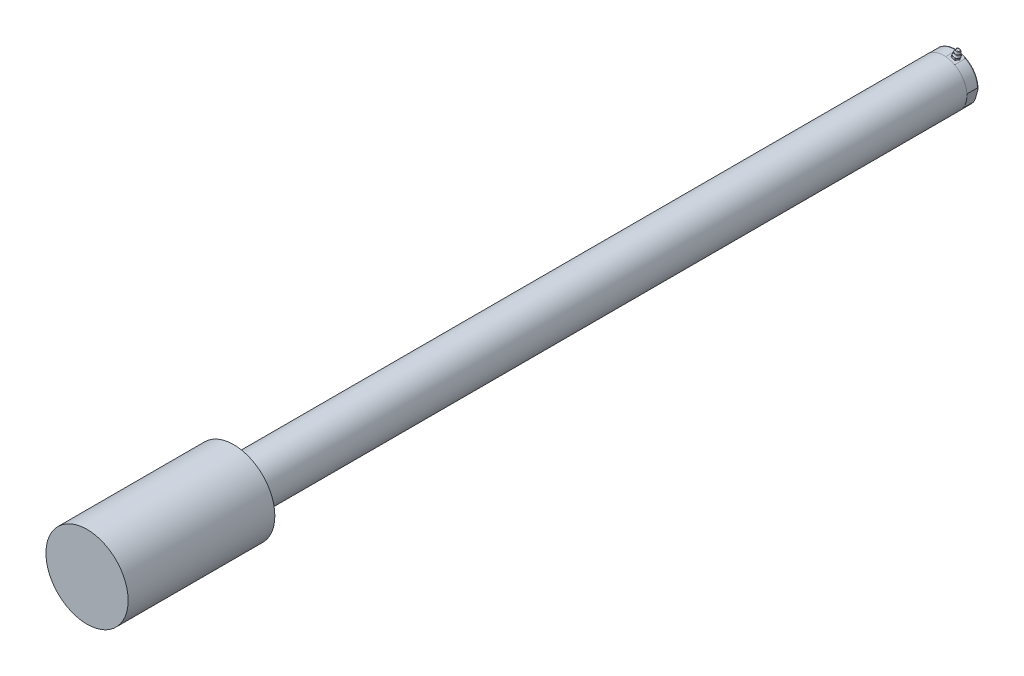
ISO-10303-21;
HEADER;
FILE_DESCRIPTION(('STEP AP214'),'2;1');
FILE_NAME('part.step','',(''),(''),'','','');
FILE_SCHEMA(('AUTOMOTIVE_DESIGN { 1 0 10303 214 1 1 1 1 }'));
ENDSEC;
DATA;
#1=APPLICATION_CONTEXT('core data for automotive mechanical design processes');
#2=APPLICATION_PROTOCOL_DEFINITION('international standard','automotive_design',2000,#1);
#3=PRODUCT_CONTEXT('',#1,'mechanical');
#4=PRODUCT('Part','Part','',(#3));
#5=PRODUCT_RELATED_PRODUCT_CATEGORY('part','',(#4));
#6=PRODUCT_DEFINITION_FORMATION('','',#4);
#7=PRODUCT_DEFINITION_CONTEXT('part definition',#1,'design');
#8=PRODUCT_DEFINITION('design','',#6,#7);
#9=PRODUCT_DEFINITION_SHAPE('','',#8);
#10=(LENGTH_UNIT() NAMED_UNIT(*) SI_UNIT(.MILLI.,.METRE.));
#11=(NAMED_UNIT(*) PLANE_ANGLE_UNIT() SI_UNIT($,.RADIAN.));
#12=(NAMED_UNIT(*) SI_UNIT($,.STERADIAN.) SOLID_ANGLE_UNIT());
#13=UNCERTAINTY_MEASURE_WITH_UNIT(LENGTH_MEASURE(1.E-05),#10,'distance_accuracy_value','');
#14=(GEOMETRIC_REPRESENTATION_CONTEXT(3) GLOBAL_UNCERTAINTY_ASSIGNED_CONTEXT((#13)) GLOBAL_UNIT_ASSIGNED_CONTEXT((#10,
#11,#12)) REPRESENTATION_CONTEXT('',''));
#15=CARTESIAN_POINT('',(0.,0.,0.));
#16=DIRECTION('',(0.,0.,1.));
#17=DIRECTION('',(1.,0.,0.));
#18=AXIS2_PLACEMENT_3D('',#15,#16,#17);
#19=CARTESIAN_POINT('',(13.1945936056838,25.2173381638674,-813.406389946));
#20=DIRECTION('',(-0.275637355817,-0.961261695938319,0.));
#21=DIRECTION('',(0.,0.,1.));
#22=AXIS2_PLACEMENT_3D('',#19,#20,#21);
#23=PLANE('',#22);
#24=CARTESIAN_POINT('',(7.68404845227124,26.7974615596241,-909.701));
#25=DIRECTION('',(-0.275637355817,-0.961261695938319,0.));
#26=DIRECTION('',(0.832477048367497,-0.238708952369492,-0.5));
#27=AXIS2_PLACEMENT_3D('',#24,#25,#26);
#28=CIRCLE('',#27,3.2385);
#29=CARTESIAN_POINT('',(10.3800253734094,26.0244026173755,-911.32025));
#30=VERTEX_POINT('',#29);
#31=EDGE_CURVE('E180',#30,#30,#28,.T.);
#32=ORIENTED_EDGE('',*,*,#31,.T.);
#33=EDGE_LOOP('',(#32));
#34=FACE_BOUND('',#33,.T.);
#35=DIRECTION('',(0.961261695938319,-0.275637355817,0.));
#36=VECTOR('',#35,1.);
#37=CARTESIAN_POINT('',(13.1945936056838,25.2173381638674,-902.335));
#38=LINE('',#37,#36);
#39=CARTESIAN_POINT('',(2.17350329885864,28.3775849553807,-902.335));
#40=VERTEX_POINT('',#39);
#41=CARTESIAN_POINT('',(13.1945936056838,25.2173381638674,-902.335));
#42=VERTEX_POINT('',#41);
#43=EDGE_CURVE('E246',#40,#42,#38,.T.);
#44=ORIENTED_EDGE('',*,*,#43,.T.);
#45=DIRECTION('',(0.,0.,-1.));
#46=VECTOR('',#45,1.);
#47=CARTESIAN_POINT('',(13.1945936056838,25.2173381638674,-813.406389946));
#48=LINE('',#47,#46);
#49=CARTESIAN_POINT('',(13.1945936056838,25.2173381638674,-915.4795));
#50=VERTEX_POINT('',#49);
#51=EDGE_CURVE('E88',#42,#50,#48,.T.);
#52=ORIENTED_EDGE('',*,*,#51,.T.);
#53=CARTESIAN_POINT('',(7.68404845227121,26.797461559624,-916.709040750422));
#54=CARTESIAN_POINT('',(7.93921694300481,26.7242931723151,-916.709044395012));
#55=CARTESIAN_POINT('',(8.1943892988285,26.6511236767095,-916.705973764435));
#56=CARTESIAN_POINT('',(8.70467891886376,26.5048004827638,-916.693356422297));
#57=CARTESIAN_POINT('',(8.95979612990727,26.4316467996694,-916.683807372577));
#58=CARTESIAN_POINT('',(9.46898922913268,26.2856380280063,-916.657195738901));
#59=CARTESIAN_POINT('',(9.72306605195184,26.2127826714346,-916.640153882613));
#60=CARTESIAN_POINT('',(10.1035622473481,26.103677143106,-916.607370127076));
#61=CARTESIAN_POINT('',(10.2302707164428,26.0673440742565,-916.595241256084));
#62=CARTESIAN_POINT('',(10.4834054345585,25.9947588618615,-916.568152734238));
#63=CARTESIAN_POINT('',(10.6098316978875,25.9585067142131,-916.553193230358));
#64=CARTESIAN_POINT('',(10.862404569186,25.8860826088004,-916.519878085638));
#65=CARTESIAN_POINT('',(10.9885507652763,25.8499107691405,-916.501519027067));
#66=CARTESIAN_POINT('',(11.2402796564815,25.7777286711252,-916.460632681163));
#67=CARTESIAN_POINT('',(11.3658621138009,25.7417184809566,-916.438103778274));
#68=CARTESIAN_POINT('',(11.6166331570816,25.669811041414,-916.387627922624));
#69=CARTESIAN_POINT('',(11.7418172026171,25.6339150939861,-916.359656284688));
#70=CARTESIAN_POINT('',(11.9904734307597,25.562614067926,-916.296622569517));
#71=CARTESIAN_POINT('',(12.1139471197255,25.5272085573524,-916.261567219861));
#72=CARTESIAN_POINT('',(12.2974101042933,25.4746013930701,-916.201080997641));
#73=CARTESIAN_POINT('',(12.3585615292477,25.4570665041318,-916.179479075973));
#74=CARTESIAN_POINT('',(12.4797823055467,25.42230700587,-916.132922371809));
#75=CARTESIAN_POINT('',(12.5398502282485,25.4050828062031,-916.10796348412));
#76=CARTESIAN_POINT('',(12.6576853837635,25.371294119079,-916.053934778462));
#77=CARTESIAN_POINT('',(12.7154673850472,25.354725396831,-916.024900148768));
#78=CARTESIAN_POINT('',(12.8279625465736,25.3224679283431,-915.961065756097));
#79=CARTESIAN_POINT('',(12.8826838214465,25.3067768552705,-915.92628230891));
#80=CARTESIAN_POINT('',(12.9619766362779,25.2840400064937,-915.86657972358));
#81=CARTESIAN_POINT('',(12.9886411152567,25.2763940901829,-915.844696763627));
#82=CARTESIAN_POINT('',(13.03947516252,25.2618176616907,-915.79791568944));
#83=CARTESIAN_POINT('',(13.0636455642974,25.2548869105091,-915.773018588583));
#84=CARTESIAN_POINT('',(13.102100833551,25.2438600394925,-915.726643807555));
#85=CARTESIAN_POINT('',(13.1173088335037,25.2394992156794,-915.706005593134));
#86=CARTESIAN_POINT('',(13.1445698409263,25.2316822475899,-915.6625682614));
#87=CARTESIAN_POINT('',(13.1566291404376,25.2282242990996,-915.639773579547));
#88=CARTESIAN_POINT('',(13.1738017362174,25.2233001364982,-915.598273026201));
#89=CARTESIAN_POINT('',(13.1799029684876,25.2215506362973,-915.580015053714));
#90=CARTESIAN_POINT('',(13.1891093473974,25.2189107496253,-915.542700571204));
#91=CARTESIAN_POINT('',(13.192218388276,25.2180192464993,-915.523645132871));
#92=CARTESIAN_POINT('',(13.1951035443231,25.2171919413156,-915.485169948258));
#93=CARTESIAN_POINT('',(13.1948648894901,25.2172603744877,-915.46574896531));
#94=CARTESIAN_POINT('',(13.1910489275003,25.2183545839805,-915.427263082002));
#95=CARTESIAN_POINT('',(13.1874689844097,25.219381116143,-915.408198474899));
#96=CARTESIAN_POINT('',(13.1764170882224,25.2225501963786,-915.367464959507));
#97=CARTESIAN_POINT('',(13.1683424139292,25.2248655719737,-915.345975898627));
#98=CARTESIAN_POINT('',(13.148976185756,25.2304187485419,-915.304637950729));
#99=CARTESIAN_POINT('',(13.1376784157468,25.2336583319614,-915.284792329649));
#100=CARTESIAN_POINT('',(13.1049289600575,25.2430490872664,-915.234879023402));
#101=CARTESIAN_POINT('',(13.0815504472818,25.2497527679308,-915.20619740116));
#102=CARTESIAN_POINT('',(13.0311167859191,25.2642143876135,-915.152618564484));
#103=CARTESIAN_POINT('',(13.004051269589,25.2719752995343,-915.127732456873));
#104=CARTESIAN_POINT('',(12.9376733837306,25.2910088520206,-915.072719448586));
#105=CARTESIAN_POINT('',(12.8974125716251,25.3025534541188,-915.043847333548));
#106=CARTESIAN_POINT('',(12.8144397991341,25.3263455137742,-914.990145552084));
#107=CARTESIAN_POINT('',(12.7717229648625,25.3385943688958,-914.965324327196));
#108=CARTESIAN_POINT('',(12.6845303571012,25.3635964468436,-914.91868901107));
#109=CARTESIAN_POINT('',(12.6400464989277,25.3763519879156,-914.896891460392));
#110=CARTESIAN_POINT('',(12.5500818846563,25.4021489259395,-914.855821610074));
#111=CARTESIAN_POINT('',(12.5046021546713,25.4151900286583,-914.836546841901));
#112=CARTESIAN_POINT('',(12.3762237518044,25.4520019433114,-914.785402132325));
#113=CARTESIAN_POINT('',(12.2924959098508,25.4760105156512,-914.755791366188));
#114=CARTESIAN_POINT('',(12.1236063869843,25.5244388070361,-914.701328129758));
#115=CARTESIAN_POINT('',(12.0384438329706,25.548858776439,-914.676478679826));
#116=CARTESIAN_POINT('',(11.8670269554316,25.5980117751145,-914.630437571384));
#117=CARTESIAN_POINT('',(11.7807707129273,25.6227453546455,-914.609253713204));
#118=CARTESIAN_POINT('',(11.60762473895,25.6723941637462,-914.569879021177));
#119=CARTESIAN_POINT('',(11.5207349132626,25.6973094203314,-914.551688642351));
#120=CARTESIAN_POINT('',(11.2591506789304,25.7723174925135,-914.500753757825));
#121=CARTESIAN_POINT('',(11.0837911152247,25.8226010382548,-914.471708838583));
#122=CARTESIAN_POINT('',(10.7323806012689,25.9233663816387,-914.420793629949));
#123=CARTESIAN_POINT('',(10.556330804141,25.9738478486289,-914.39891432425));
#124=CARTESIAN_POINT('',(10.2057483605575,26.0743757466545,-914.360906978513));
#125=CARTESIAN_POINT('',(10.0312220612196,26.1244203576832,-914.344714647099));
#126=CARTESIAN_POINT('',(9.6818393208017,26.2246042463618,-914.316705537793));
#127=CARTESIAN_POINT('',(9.50698285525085,26.2747435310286,-914.304889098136));
#128=CARTESIAN_POINT('',(9.15695925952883,26.3751111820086,-914.284948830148));
#129=CARTESIAN_POINT('',(8.98179199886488,26.42533958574,-914.27682752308));
#130=CARTESIAN_POINT('',(8.63134183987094,26.52582955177,-914.263847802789));
#131=CARTESIAN_POINT('',(8.45605893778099,26.5760911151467,-914.258989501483));
#132=CARTESIAN_POINT('',(8.10584886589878,26.6765122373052,-914.252289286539));
#133=CARTESIAN_POINT('',(7.93092181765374,26.7266717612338,-914.250440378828));
#134=CARTESIAN_POINT('',(7.58106158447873,26.8269925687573,-914.24964223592));
#135=CARTESIAN_POINT('',(7.40612839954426,26.8771538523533,-914.250693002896));
#136=CARTESIAN_POINT('',(7.05636573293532,26.9774466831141,-914.255747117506));
#137=CARTESIAN_POINT('',(6.88153623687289,27.0275782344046,-914.259749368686));
#138=CARTESIAN_POINT('',(6.53197398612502,27.127813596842,-914.270912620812));
#139=CARTESIAN_POINT('',(6.35724122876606,27.1779174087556,-914.2780735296));
#140=CARTESIAN_POINT('',(6.00820022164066,27.2780033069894,-914.295922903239));
#141=CARTESIAN_POINT('',(5.8338917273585,27.3279854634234,-914.306606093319));
#142=CARTESIAN_POINT('',(5.48552761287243,27.4278772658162,-914.332103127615));
#143=CARTESIAN_POINT('',(5.31147202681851,27.4777869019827,-914.346917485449));
#144=CARTESIAN_POINT('',(4.96371195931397,27.5775054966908,-914.381582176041));
#145=CARTESIAN_POINT('',(4.79000773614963,27.62731438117,-914.401435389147));
#146=CARTESIAN_POINT('',(4.44341751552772,27.7266975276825,-914.447537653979));
#147=CARTESIAN_POINT('',(4.27053132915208,27.7762718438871,-914.473785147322));
#148=CARTESIAN_POINT('',(3.92575196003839,27.8751357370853,-914.534856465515));
#149=CARTESIAN_POINT('',(3.75386128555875,27.9244245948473,-914.569696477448));
#150=CARTESIAN_POINT('',(3.49824924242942,27.997720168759,-914.631241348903));
#151=CARTESIAN_POINT('',(3.4134930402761,28.0220236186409,-914.653279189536));
#152=CARTESIAN_POINT('',(3.24502150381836,28.0703320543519,-914.701274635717));
#153=CARTESIAN_POINT('',(3.16130581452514,28.0943371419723,-914.727230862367));
#154=CARTESIAN_POINT('',(3.01384549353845,28.1366207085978,-914.777961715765));
#155=CARTESIAN_POINT('',(2.94978182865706,28.1549906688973,-914.801726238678));
#156=CARTESIAN_POINT('',(2.82299524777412,28.1913461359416,-914.853320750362));
#157=CARTESIAN_POINT('',(2.76027533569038,28.2093307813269,-914.881158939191));
#158=CARTESIAN_POINT('',(2.63682310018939,28.2447301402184,-914.942479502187));
#159=CARTESIAN_POINT('',(2.57610994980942,28.2621393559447,-914.976003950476));
#160=CARTESIAN_POINT('',(2.45920418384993,28.2956615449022,-915.050919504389));
#161=CARTESIAN_POINT('',(2.40299831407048,28.311778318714,-915.092286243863));
#162=CARTESIAN_POINT('',(2.32796695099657,28.3332932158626,-915.161861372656));
#163=CARTESIAN_POINT('',(2.30516677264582,28.3398310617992,-915.185356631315));
#164=CARTESIAN_POINT('',(2.26313676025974,28.3518829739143,-915.235586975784));
#165=CARTESIAN_POINT('',(2.24389550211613,28.3574003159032,-915.262311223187));
#166=CARTESIAN_POINT('',(2.21725396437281,28.3650396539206,-915.308517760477));
#167=CARTESIAN_POINT('',(2.20812847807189,28.3676563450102,-915.326912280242));
#168=CARTESIAN_POINT('',(2.19272755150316,28.3720724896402,-915.364962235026));
#169=CARTESIAN_POINT('',(2.18644913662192,28.3738727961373,-915.38461632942));
#170=CARTESIAN_POINT('',(2.17734862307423,28.3764823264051,-915.425007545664));
#171=CARTESIAN_POINT('',(2.17456182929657,28.3772814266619,-915.445753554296));
#172=CARTESIAN_POINT('',(2.17294645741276,28.3777446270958,-915.487410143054));
#173=CARTESIAN_POINT('',(2.17411601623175,28.3774092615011,-915.508320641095));
#174=CARTESIAN_POINT('',(2.17985758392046,28.3757628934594,-915.546966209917));
#175=CARTESIAN_POINT('',(2.18399258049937,28.3745772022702,-915.564775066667));
#176=CARTESIAN_POINT('',(2.1947733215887,28.3714858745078,-915.59954311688));
#177=CARTESIAN_POINT('',(2.20142071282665,28.369579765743,-915.616501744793));
#178=CARTESIAN_POINT('',(2.22119879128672,28.3639084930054,-915.658918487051));
#179=CARTESIAN_POINT('',(2.23585369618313,28.3597062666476,-915.683602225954));
#180=CARTESIAN_POINT('',(2.26860271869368,28.3503156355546,-915.730357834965));
#181=CARTESIAN_POINT('',(2.28670730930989,28.3451242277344,-915.75242141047));
#182=CARTESIAN_POINT('',(2.34238918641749,28.3291577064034,-915.812971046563));
#183=CARTESIAN_POINT('',(2.3829005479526,28.3175412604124,-915.848496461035));
#184=CARTESIAN_POINT('',(2.46800637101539,28.2931375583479,-915.913672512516));
#185=CARTESIAN_POINT('',(2.51261288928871,28.2803468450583,-915.943304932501));
#186=CARTESIAN_POINT('',(2.63316751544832,28.2457783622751,-916.015731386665));
#187=CARTESIAN_POINT('',(2.71106801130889,28.2234407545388,-916.054970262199));
#188=CARTESIAN_POINT('',(2.86995179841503,28.1778815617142,-916.126126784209));
#189=CARTESIAN_POINT('',(2.95094220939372,28.1546579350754,-916.158026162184));
#190=CARTESIAN_POINT('',(3.11509152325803,28.1075888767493,-916.216655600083));
#191=CARTESIAN_POINT('',(3.1982595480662,28.0837408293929,-916.243357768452));
#192=CARTESIAN_POINT('',(3.36557833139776,28.0357629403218,-916.292654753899));
#193=CARTESIAN_POINT('',(3.44972774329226,28.0116334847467,-916.315254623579));
#194=CARTESIAN_POINT('',(3.61866685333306,27.9631909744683,-916.357208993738));
#195=CARTESIAN_POINT('',(3.70345575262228,27.9388781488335,-916.376567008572));
#196=CARTESIAN_POINT('',(3.87355288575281,27.8901035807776,-916.412648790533));
#197=CARTESIAN_POINT('',(3.95886117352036,27.8656418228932,-916.429372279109));
#198=CARTESIAN_POINT('',(4.21541529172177,27.7920761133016,-916.476266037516));
#199=CARTESIAN_POINT('',(4.38721761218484,27.7428125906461,-916.503142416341));
#200=CARTESIAN_POINT('',(4.73196651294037,27.6439574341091,-916.550448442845));
#201=CARTESIAN_POINT('',(4.90491472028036,27.5943653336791,-916.570864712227));
#202=CARTESIAN_POINT('',(5.25130792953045,27.4950386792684,-916.606574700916));
#203=CARTESIAN_POINT('',(5.42475297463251,27.4453041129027,-916.621867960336));
#204=CARTESIAN_POINT('',(5.77192404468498,27.3457544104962,-916.64826484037));
#205=CARTESIAN_POINT('',(5.94565005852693,27.2959392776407,-916.659368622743));
#206=CARTESIAN_POINT('',(6.29328624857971,27.1962562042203,-916.67800919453));
#207=CARTESIAN_POINT('',(6.46719643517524,27.1463882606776,-916.685545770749));
#208=CARTESIAN_POINT('',(6.81490761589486,27.0466836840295,-916.697445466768));
#209=CARTESIAN_POINT('',(6.98870849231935,26.9968470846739,-916.701812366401));
#210=CARTESIAN_POINT('',(7.33635513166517,26.897161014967,-916.707608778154));
#211=CARTESIAN_POINT('',(7.5102008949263,26.8473115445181,-916.709038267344));
#212=CARTESIAN_POINT('',(7.68404845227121,26.797461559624,-916.709040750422));
#213=B_SPLINE_CURVE_WITH_KNOTS('',3,(#53,#54,#55,#56,#57,#58,#59,#60,#61,#62,#63,#64,#65,#66,
#67,#68,#69,#70,#71,#72,#73,#74,#75,#76,#77,#78,#79,#80,#81,#82,#83,#84,#85,#86,#87,#88,#89,#90,
#91,#92,#93,#94,#95,#96,#97,#98,#99,#100,#101,#102,#103,#104,#105,#106,#107,#108,#109,#110,#111,
#112,#113,#114,#115,#116,#117,#118,#119,#120,#121,#122,#123,#124,#125,#126,#127,#128,#129,#130,
#131,#132,#133,#134,#135,#136,#137,#138,#139,#140,#141,#142,#143,#144,#145,#146,#147,#148,#149,
#150,#151,#152,#153,#154,#155,#156,#157,#158,#159,#160,#161,#162,#163,#164,#165,#166,#167,#168,
#169,#170,#171,#172,#173,#174,#175,#176,#177,#178,#179,#180,#181,#182,#183,#184,#185,#186,#187,
#188,#189,#190,#191,#192,#193,#194,#195,#196,#197,#198,#199,#200,#201,#202,#203,#204,#205,#206,
#207,#208,#209,#210,#211,#212),.UNSPECIFIED.,.T.,.F.,(4,2,2,2,2,2,2,2,2,2,2,2,2,2,2,2,2,2,2,2,2,
2,2,2,2,2,2,2,2,2,2,2,2,2,2,2,2,2,2,2,2,2,2,2,2,2,2,2,2,2,2,2,2,2,2,2,2,2,2,2,2,2,2,2,2,2,2,2,2,
2,2,2,2,2,2,2,2,2,2,4),(0.,0.79634156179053,1.59297068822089,2.38740979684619,2.78450105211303,
3.18157169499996,3.57904372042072,3.97667006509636,4.37614372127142,4.77523975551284,
4.97672550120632,5.17845992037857,5.37854902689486,5.57807971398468,5.68392945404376,
5.78974370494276,5.86754736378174,5.94519433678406,6.00295588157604,6.06064214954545,
6.11858300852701,6.17656961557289,6.24540204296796,6.31436813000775,6.42654493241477,
6.53904394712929,6.69128933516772,6.84384804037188,6.99721089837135,7.15042255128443,
7.42619901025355,7.70214983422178,7.9786808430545,8.25525384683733,8.80920045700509,
9.3624473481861,9.90922160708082,10.4560381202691,11.0032271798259,11.5504350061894,
12.0963692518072,12.6423039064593,13.1880358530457,13.7337518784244,14.2786543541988,
14.8236246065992,15.3689070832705,15.9140567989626,16.4602414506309,16.7328314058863,
17.0053256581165,17.2175058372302,17.4301191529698,17.6443803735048,17.8579864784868,
17.9579154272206,18.0575178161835,18.1194185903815,18.1812545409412,18.2437108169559,
18.3061376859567,18.3608722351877,18.4156427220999,18.5021761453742,18.5889765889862,
18.7534080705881,18.9183402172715,19.1877629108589,19.4578491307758,19.7293470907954,
20.0005083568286,20.2713737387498,20.5422677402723,21.0842883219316,21.6274241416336,
22.1706087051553,22.7137722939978,23.2569683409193,23.7995155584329,24.3420670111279),.UNSPECIFIED.);
#214=CARTESIAN_POINT('',(2.17350329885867,28.3775849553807,-915.4795));
#215=VERTEX_POINT('',#214);
#216=EDGE_CURVE('E238',#215,#50,#213,.T.);
#217=ORIENTED_EDGE('',*,*,#216,.F.);
#218=DIRECTION('',(0.,0.,-1.));
#219=VECTOR('',#218,1.);
#220=CARTESIAN_POINT('',(2.17350329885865,28.3775849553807,-813.406389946));
#221=LINE('',#220,#219);
#222=EDGE_CURVE('E236',#40,#215,#221,.T.);
#223=ORIENTED_EDGE('',*,*,#222,.F.);
#224=EDGE_LOOP('',(#44,#52,#217,#223));
#225=FACE_BOUND('',#224,.T.);
#226=ADVANCED_FACE('F17',(#34,#225),#23,.F.);
#227=CARTESIAN_POINT('',(0.,0.,-902.335));
#228=DIRECTION('',(0.,0.,-1.));
#229=DIRECTION('',(-1.,0.,0.));
#230=AXIS2_PLACEMENT_3D('',#227,#228,#229);
#231=PLANE('',#230);
#232=CARTESIAN_POINT('',(0.,0.,-902.335));
#233=DIRECTION('',(0.,0.,-1.));
#234=DIRECTION('',(-1.,0.,0.));
#235=AXIS2_PLACEMENT_3D('',#232,#233,#234);
#236=CIRCLE('',#235,28.56738);
#237=CARTESIAN_POINT('',(-28.56738,0.,-902.335));
#238=VERTEX_POINT('',#237);
#239=EDGE_CURVE('E21',#238,#238,#236,.T.);
#240=ORIENTED_EDGE('',*,*,#239,.T.);
#241=EDGE_LOOP('',(#240));
#242=FACE_BOUND('',#241,.T.);
#243=CARTESIAN_POINT('',(0.,0.,-902.335));
#244=DIRECTION('',(0.,0.,-1.));
#245=DIRECTION('',(-0.275637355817,-0.961261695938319,0.));
#246=AXIS2_PLACEMENT_3D('',#243,#244,#245);
#247=CIRCLE('',#246,28.4607);
#248=CARTESIAN_POINT('',(28.4238996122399,1.44685013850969,-902.335));
#249=VERTEX_POINT('',#248);
#250=EDGE_CURVE('E401',#42,#249,#247,.T.);
#251=ORIENTED_EDGE('',*,*,#250,.F.);
#252=ORIENTED_EDGE('',*,*,#43,.F.);
#253=CARTESIAN_POINT('',(-23.3381201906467,16.2893704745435,-902.335));
#254=VERTEX_POINT('',#253);
#255=EDGE_CURVE('E399',#254,#40,#247,.T.);
#256=ORIENTED_EDGE('',*,*,#255,.F.);
#257=DIRECTION('',(0.275637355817,0.961261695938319,0.));
#258=VECTOR('',#257,1.);
#259=CARTESIAN_POINT('',(-23.3381201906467,16.2893704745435,-902.335));
#260=LINE('',#259,#258);
#261=CARTESIAN_POINT('',(-28.42389961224,-1.44685013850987,-902.335));
#262=VERTEX_POINT('',#261);
#263=EDGE_CURVE('E427',#262,#254,#260,.T.);
#264=ORIENTED_EDGE('',*,*,#263,.F.);
#265=CARTESIAN_POINT('',(23.3381201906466,-16.2893704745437,-902.335));
#266=VERTEX_POINT('',#265);
#267=EDGE_CURVE('E396',#266,#262,#247,.T.);
#268=ORIENTED_EDGE('',*,*,#267,.F.);
#269=DIRECTION('',(-0.275637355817,-0.961261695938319,0.));
#270=VECTOR('',#269,1.);
#271=CARTESIAN_POINT('',(28.4238996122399,1.44685013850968,-902.335));
#272=LINE('',#271,#270);
#273=EDGE_CURVE('E403',#249,#266,#272,.T.);
#274=ORIENTED_EDGE('',*,*,#273,.F.);
#275=EDGE_LOOP('',(#251,#252,#256,#264,#268,#274));
#276=FACE_BOUND('',#275,.T.);
#277=ADVANCED_FACE('F347',(#242,#276),#231,.T.);
#278=CARTESIAN_POINT('',(0.,0.,-919.759212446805));
#279=DIRECTION('',(0.,0.,-1.));
#280=DIRECTION('',(-0.275637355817,-0.961261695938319,0.));
#281=AXIS2_PLACEMENT_3D('',#278,#279,#280);
#282=CYLINDRICAL_SURFACE('',#281,28.4607);
#283=CARTESIAN_POINT('',(0.,0.,-915.4795));
#284=DIRECTION('',(0.,0.,1.));
#285=DIRECTION('',(0.275637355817,0.961261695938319,0.));
#286=AXIS2_PLACEMENT_3D('',#283,#284,#285);
#287=CIRCLE('',#286,28.4607);
#288=CARTESIAN_POINT('',(28.4238996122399,1.44685013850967,-915.4795));
#289=VERTEX_POINT('',#288);
#290=EDGE_CURVE('E332',#289,#50,#287,.T.);
#291=ORIENTED_EDGE('',*,*,#290,.T.);
#292=ORIENTED_EDGE('',*,*,#51,.F.);
#293=ORIENTED_EDGE('',*,*,#250,.T.);
#294=DIRECTION('',(0.,0.,-1.));
#295=VECTOR('',#294,1.);
#296=CARTESIAN_POINT('',(28.4238996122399,1.44685013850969,-813.406389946));
#297=LINE('',#296,#295);
#298=EDGE_CURVE('E386',#249,#289,#297,.T.);
#299=ORIENTED_EDGE('',*,*,#298,.T.);
#300=EDGE_LOOP('',(#291,#292,#293,#299));
#301=FACE_BOUND('',#300,.T.);
#302=ADVANCED_FACE('F364',(#301),#282,.T.);
#303=CARTESIAN_POINT('',(0.,0.,-915.4795));
#304=DIRECTION('',(0.,0.,1.));
#305=DIRECTION('',(0.275637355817,0.961261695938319,0.));
#306=AXIS2_PLACEMENT_3D('',#303,#304,#305);
#307=TOROIDAL_SURFACE('',#306,26.8732,1.5875);
#308=ORIENTED_EDGE('',*,*,#216,.T.);
#309=ORIENTED_EDGE('',*,*,#290,.F.);
#310=CARTESIAN_POINT('',(25.8810099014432,-7.421260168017,-917.066186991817));
#311=CARTESIAN_POINT('',(25.8080981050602,-7.67553381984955,-917.066187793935));
#312=CARTESIAN_POINT('',(25.7351863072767,-7.92980747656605,-917.066076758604));
#313=CARTESIAN_POINT('',(25.5893626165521,-8.43835512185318,-917.065462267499));
#314=CARTESIAN_POINT('',(25.5164507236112,-8.69262911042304,-917.064958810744));
#315=CARTESIAN_POINT('',(25.370588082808,-9.20131259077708,-917.063042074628));
#316=CARTESIAN_POINT('',(25.2976373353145,-9.45572208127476,-917.061628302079));
#317=CARTESIAN_POINT('',(25.1517426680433,-9.96451725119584,-917.057027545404));
#318=CARTESIAN_POINT('',(25.0787987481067,-10.2189029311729,-917.053840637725));
#319=CARTESIAN_POINT('',(24.9328607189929,-10.7278493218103,-917.044465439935));
#320=CARTESIAN_POINT('',(24.8598666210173,-10.9824099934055,-917.038274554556));
#321=CARTESIAN_POINT('',(24.7139217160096,-11.4913803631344,-917.021246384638));
#322=CARTESIAN_POINT('',(24.6409709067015,-11.7457900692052,-917.010409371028));
#323=CARTESIAN_POINT('',(24.4951050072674,-12.2544849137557,-916.981916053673));
#324=CARTESIAN_POINT('',(24.4221899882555,-12.5087698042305,-916.964254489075));
#325=CARTESIAN_POINT('',(24.3129990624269,-12.8895638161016,-916.930391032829));
#326=CARTESIAN_POINT('',(24.2766365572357,-13.0163749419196,-916.917876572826));
#327=CARTESIAN_POINT('',(24.2039990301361,-13.2696921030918,-916.88988542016));
#328=CARTESIAN_POINT('',(24.167724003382,-13.3961981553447,-916.874408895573));
#329=CARTESIAN_POINT('',(24.095164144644,-13.6492444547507,-916.839823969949));
#330=CARTESIAN_POINT('',(24.058879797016,-13.7757830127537,-916.820702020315));
#331=CARTESIAN_POINT('',(23.9864963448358,-14.0282141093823,-916.778075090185));
#332=CARTESIAN_POINT('',(23.9503972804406,-14.154106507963,-916.754569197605));
#333=CARTESIAN_POINT('',(23.8785979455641,-14.4045005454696,-916.702207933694));
#334=CARTESIAN_POINT('',(23.8428968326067,-14.5290051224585,-916.673367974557));
#335=CARTESIAN_POINT('',(23.7719721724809,-14.7763488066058,-916.608877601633));
#336=CARTESIAN_POINT('',(23.7367483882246,-14.8991887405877,-916.573230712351));
#337=CARTESIAN_POINT('',(23.6782653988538,-15.1031431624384,-916.505851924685));
#338=CARTESIAN_POINT('',(23.6547966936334,-15.1849882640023,-916.4765393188));
#339=CARTESIAN_POINT('',(23.6083327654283,-15.3470272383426,-916.4126842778));
#340=CARTESIAN_POINT('',(23.5853389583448,-15.4272161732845,-916.378128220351));
#341=CARTESIAN_POINT('',(23.5367774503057,-15.5965702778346,-916.296755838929));
#342=CARTESIAN_POINT('',(23.5113381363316,-15.6852877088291,-916.2488792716));
#343=CARTESIAN_POINT('',(23.4747352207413,-15.8129372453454,-916.168094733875));
#344=CARTESIAN_POINT('',(23.4628126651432,-15.8545161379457,-916.139727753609));
#345=CARTESIAN_POINT('',(23.4396920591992,-15.9351472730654,-916.079373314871));
#346=CARTESIAN_POINT('',(23.4284931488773,-15.9742025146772,-916.04739028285));
#347=CARTESIAN_POINT('',(23.4093779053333,-16.0408652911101,-915.986190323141));
#348=CARTESIAN_POINT('',(23.4012645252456,-16.0691600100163,-915.957791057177));
#349=CARTESIAN_POINT('',(23.3859496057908,-16.1225694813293,-915.897810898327));
#350=CARTESIAN_POINT('',(23.378749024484,-16.1476808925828,-915.866226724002));
#351=CARTESIAN_POINT('',(23.3655679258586,-16.1936488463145,-915.799162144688));
#352=CARTESIAN_POINT('',(23.3596046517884,-16.2144452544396,-915.763636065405));
#353=CARTESIAN_POINT('',(23.3495893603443,-16.2493727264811,-915.689202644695));
#354=CARTESIAN_POINT('',(23.345531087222,-16.2635256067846,-915.650306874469));
#355=CARTESIAN_POINT('',(23.3406930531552,-16.2803978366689,-915.581603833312));
#356=CARTESIAN_POINT('',(23.3393091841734,-16.2852239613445,-915.55235708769));
#357=CARTESIAN_POINT('',(23.3379402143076,-16.2899981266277,-915.493434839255));
#358=CARTESIAN_POINT('',(23.337954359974,-16.2899487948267,-915.463759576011));
#359=CARTESIAN_POINT('',(23.3393791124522,-16.2849800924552,-915.404906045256));
#360=CARTESIAN_POINT('',(23.3407878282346,-16.2800673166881,-915.375727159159));
#361=CARTESIAN_POINT('',(23.3448609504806,-16.265862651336,-915.318551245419));
#362=CARTESIAN_POINT('',(23.3475264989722,-16.2565667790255,-915.290555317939));
#363=CARTESIAN_POINT('',(23.3552585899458,-16.2296017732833,-915.224678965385));
#364=CARTESIAN_POINT('',(23.3608639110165,-16.2100536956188,-915.187636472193));
#365=CARTESIAN_POINT('',(23.3736016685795,-16.1656318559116,-915.117199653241));
#366=CARTESIAN_POINT('',(23.3807379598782,-16.1407446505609,-915.08381486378));
#367=CARTESIAN_POINT('',(23.401692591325,-16.0676671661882,-914.997192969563));
#368=CARTESIAN_POINT('',(23.416570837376,-16.015780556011,-914.94737050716));
#369=CARTESIAN_POINT('',(23.4480757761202,-15.9059097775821,-914.855751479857));
#370=CARTESIAN_POINT('',(23.4647073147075,-15.8479087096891,-914.813978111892));
#371=CARTESIAN_POINT('',(23.5059930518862,-15.7039282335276,-914.720876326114));
#372=CARTESIAN_POINT('',(23.5311591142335,-15.6161637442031,-914.672571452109));
#373=CARTESIAN_POINT('',(23.5826397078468,-15.4366295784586,-914.584672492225));
#374=CARTESIAN_POINT('',(23.6089565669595,-15.3448517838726,-914.545097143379));
#375=CARTESIAN_POINT('',(23.6624024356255,-15.1584638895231,-914.472430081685));
#376=CARTESIAN_POINT('',(23.6895348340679,-15.0638419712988,-914.439371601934));
#377=CARTESIAN_POINT('',(23.7442089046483,-14.8731708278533,-914.378571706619));
#378=CARTESIAN_POINT('',(23.7717501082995,-14.7771232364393,-914.35082464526));
#379=CARTESIAN_POINT('',(23.825570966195,-14.5894275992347,-914.301037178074));
#380=CARTESIAN_POINT('',(23.8518344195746,-14.4978360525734,-914.278763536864));
#381=CARTESIAN_POINT('',(23.9045519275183,-14.3139882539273,-914.237394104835));
#382=CARTESIAN_POINT('',(23.931006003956,-14.2217319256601,-914.218298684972));
#383=CARTESIAN_POINT('',(24.0105995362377,-13.9441562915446,-914.16501432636));
#384=CARTESIAN_POINT('',(24.0639437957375,-13.7581227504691,-914.134850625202));
#385=CARTESIAN_POINT('',(24.1710414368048,-13.3846288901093,-914.082399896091));
#386=CARTESIAN_POINT('',(24.2247954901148,-13.1971662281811,-914.060131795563));
#387=CARTESIAN_POINT('',(24.3324716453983,-12.8216548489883,-914.021662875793));
#388=CARTESIAN_POINT('',(24.3863937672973,-12.6336060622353,-914.00546280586));
#389=CARTESIAN_POINT('',(24.4943920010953,-12.2569714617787,-913.977692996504));
#390=CARTESIAN_POINT('',(24.5484682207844,-12.0683852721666,-913.966128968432));
#391=CARTESIAN_POINT('',(24.6566714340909,-11.6910358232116,-913.946555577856));
#392=CARTESIAN_POINT('',(24.7107984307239,-11.5022725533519,-913.938546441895));
#393=CARTESIAN_POINT('',(24.8189869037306,-11.1249745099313,-913.925210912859));
#394=CARTESIAN_POINT('',(24.8730483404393,-10.9364398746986,-913.919880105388));
#395=CARTESIAN_POINT('',(24.9811811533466,-10.5593359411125,-913.911175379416));
#396=CARTESIAN_POINT('',(25.0352525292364,-10.3707666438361,-913.90780140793));
#397=CARTESIAN_POINT('',(25.1955868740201,-9.81161433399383,-913.899808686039));
#398=CARTESIAN_POINT('',(25.3018566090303,-9.44100772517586,-913.897131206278));
#399=CARTESIAN_POINT('',(25.5144009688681,-8.69977745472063,-913.89387484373));
#400=CARTESIAN_POINT('',(25.6206755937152,-8.32915379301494,-913.893296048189));
#401=CARTESIAN_POINT('',(25.8334091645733,-7.58726366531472,-913.892722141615));
#402=CARTESIAN_POINT('',(25.9398681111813,-7.215997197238,-913.892728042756));
#403=CARTESIAN_POINT('',(26.1527768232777,-6.47349627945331,-913.893353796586));
#404=CARTESIAN_POINT('',(26.2592265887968,-6.10226182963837,-913.893973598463));
#405=CARTESIAN_POINT('',(26.4728342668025,-5.35732332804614,-913.897415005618));
#406=CARTESIAN_POINT('',(26.5799921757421,-4.9836192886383,-913.900251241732));
#407=CARTESIAN_POINT('',(26.7407328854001,-4.42304981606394,-913.908637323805));
#408=CARTESIAN_POINT('',(26.7943232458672,-4.23615801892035,-913.912122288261));
#409=CARTESIAN_POINT('',(26.9014911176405,-3.86241923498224,-913.921065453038));
#410=CARTESIAN_POINT('',(26.9550686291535,-3.675572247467,-913.926523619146));
#411=CARTESIAN_POINT('',(27.0620229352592,-3.30257825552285,-913.94008913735));
#412=CARTESIAN_POINT('',(27.1153998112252,-3.11643096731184,-913.948187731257));
#413=CARTESIAN_POINT('',(27.2221033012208,-2.74431167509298,-913.967897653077));
#414=CARTESIAN_POINT('',(27.275429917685,-2.55833966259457,-913.979508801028));
#415=CARTESIAN_POINT('',(27.3819627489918,-2.18681552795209,-914.007309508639));
#416=CARTESIAN_POINT('',(27.4351690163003,-2.00126322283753,-914.023496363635));
#417=CARTESIAN_POINT('',(27.541415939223,-1.63073616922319,-914.061821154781));
#418=CARTESIAN_POINT('',(27.5944566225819,-1.44576132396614,-914.083958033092));
#419=CARTESIAN_POINT('',(27.674349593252,-1.16714142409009,-914.123310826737));
#420=CARTESIAN_POINT('',(27.7013104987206,-1.07311757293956,-914.137630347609));
#421=CARTESIAN_POINT('',(27.7551318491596,-0.885420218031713,-914.16864658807));
#422=CARTESIAN_POINT('',(27.7819922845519,-0.791746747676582,-914.185343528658));
#423=CARTESIAN_POINT('',(27.835667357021,-0.604559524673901,-914.221575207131));
#424=CARTESIAN_POINT('',(27.8624814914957,-0.511047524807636,-914.241119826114));
#425=CARTESIAN_POINT('',(27.9159083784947,-0.324725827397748,-914.283510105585));
#426=CARTESIAN_POINT('',(27.9425211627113,-0.231916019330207,-914.306355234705));
#427=CARTESIAN_POINT('',(27.9950498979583,-0.0487265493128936,-914.355622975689));
#428=CARTESIAN_POINT('',(28.0209702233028,0.0416683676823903,-914.381983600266));
#429=CARTESIAN_POINT('',(28.0724115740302,0.221065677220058,-914.439397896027));
#430=CARTESIAN_POINT('',(28.0979327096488,0.310068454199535,-914.470450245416));
#431=CARTESIAN_POINT('',(28.1482517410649,0.485551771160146,-914.538283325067));
#432=CARTESIAN_POINT('',(28.1730525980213,0.572042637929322,-914.575034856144));
#433=CARTESIAN_POINT('',(28.2216898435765,0.741660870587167,-914.656065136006));
#434=CARTESIAN_POINT('',(28.2455278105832,0.82479374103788,-914.700330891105));
#435=CARTESIAN_POINT('',(28.2777652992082,0.93721922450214,-914.769545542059));
#436=CARTESIAN_POINT('',(28.2868661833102,0.968957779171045,-914.790200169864));
#437=CARTESIAN_POINT('',(28.3047237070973,1.03123436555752,-914.833437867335));
#438=CARTESIAN_POINT('',(28.3134801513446,1.06177171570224,-914.856022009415));
#439=CARTESIAN_POINT('',(28.330500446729,1.12112853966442,-914.903302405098));
#440=CARTESIAN_POINT('',(28.3387660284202,1.14995404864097,-914.927990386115));
#441=CARTESIAN_POINT('',(28.3546744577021,1.20543333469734,-914.97985726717));
#442=CARTESIAN_POINT('',(28.3623178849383,1.23208913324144,-915.00703379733));
#443=CARTESIAN_POINT('',(28.3766107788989,1.28193437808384,-915.063644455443));
#444=CARTESIAN_POINT('',(28.383277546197,1.30518415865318,-915.093020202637));
#445=CARTESIAN_POINT('',(28.3954948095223,1.34779081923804,-915.154770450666));
#446=CARTESIAN_POINT('',(28.4010445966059,1.36714522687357,-915.187146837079));
#447=CARTESIAN_POINT('',(28.410674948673,1.40073025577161,-915.255342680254));
#448=CARTESIAN_POINT('',(28.4147328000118,1.41488166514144,-915.291205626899));
#449=CARTESIAN_POINT('',(28.4207594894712,1.43589922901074,-915.365148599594));
#450=CARTESIAN_POINT('',(28.4227345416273,1.44278705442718,-915.403221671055));
#451=CARTESIAN_POINT('',(28.4241783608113,1.44782225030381,-915.474236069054));
#452=CARTESIAN_POINT('',(28.4239787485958,1.44712611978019,-915.507090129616));
#453=CARTESIAN_POINT('',(28.4218853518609,1.43982557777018,-915.572089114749));
#454=CARTESIAN_POINT('',(28.4199900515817,1.43321588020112,-915.604233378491));
#455=CARTESIAN_POINT('',(28.4143625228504,1.4135903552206,-915.671096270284));
#456=CARTESIAN_POINT('',(28.4104159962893,1.39982718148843,-915.705572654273));
#457=CARTESIAN_POINT('',(28.4010465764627,1.36715213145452,-915.771755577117));
#458=CARTESIAN_POINT('',(28.3956211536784,1.34823143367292,-915.803457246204));
#459=CARTESIAN_POINT('',(28.3801240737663,1.29418669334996,-915.882124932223));
#460=CARTESIAN_POINT('',(28.3692135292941,1.25613710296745,-915.92688966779));
#461=CARTESIAN_POINT('',(28.3457292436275,1.17423766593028,-916.010192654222));
#462=CARTESIAN_POINT('',(28.3331509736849,1.13037202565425,-916.048713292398));
#463=CARTESIAN_POINT('',(28.3065032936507,1.03744052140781,-916.121905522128));
#464=CARTESIAN_POINT('',(28.2923976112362,0.988248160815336,-916.15640055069));
#465=CARTESIAN_POINT('',(28.2634425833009,0.887269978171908,-916.221054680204));
#466=CARTESIAN_POINT('',(28.2485924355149,0.835481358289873,-916.251208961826));
#467=CARTESIAN_POINT('',(28.2183540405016,0.730027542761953,-916.308017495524));
#468=CARTESIAN_POINT('',(28.2029646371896,0.676358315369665,-916.334663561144));
#469=CARTESIAN_POINT('',(28.1718321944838,0.567786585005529,-916.384963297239));
#470=CARTESIAN_POINT('',(28.156089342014,0.512884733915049,-916.408618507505));
#471=CARTESIAN_POINT('',(28.1126338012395,0.361337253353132,-916.46994292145));
#472=CARTESIAN_POINT('',(28.084651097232,0.263749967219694,-916.505090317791));
#473=CARTESIAN_POINT('',(28.0281760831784,0.0667981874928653,-916.569574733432));
#474=CARTESIAN_POINT('',(27.9996834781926,-0.0325673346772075,-916.598908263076));
#475=CARTESIAN_POINT('',(27.9423109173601,-0.232649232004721,-916.652956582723));
#476=CARTESIAN_POINT('',(27.9134303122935,-0.333367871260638,-916.677662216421));
#477=CARTESIAN_POINT('',(27.8554376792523,-0.535612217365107,-916.723226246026));
#478=CARTESIAN_POINT('',(27.8263256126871,-0.637138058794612,-916.744083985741));
#479=CARTESIAN_POINT('',(27.7384886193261,-0.943462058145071,-916.80204194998));
#480=CARTESIAN_POINT('',(27.6795210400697,-1.14910644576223,-916.834297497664));
#481=CARTESIAN_POINT('',(27.5613476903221,-1.56122589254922,-916.889509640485));
#482=CARTESIAN_POINT('',(27.5021422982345,-1.76769963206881,-916.912477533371));
#483=CARTESIAN_POINT('',(27.3779375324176,-2.20085312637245,-916.953406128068));
#484=CARTESIAN_POINT('',(27.3129214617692,-2.4275911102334,-916.970684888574));
#485=CARTESIAN_POINT('',(27.1827875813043,-2.88142188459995,-916.999289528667));
#486=CARTESIAN_POINT('',(27.1176697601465,-3.10851471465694,-917.010614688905));
#487=CARTESIAN_POINT('',(26.9873425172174,-3.56301982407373,-917.029003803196));
#488=CARTESIAN_POINT('',(26.9221330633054,-3.79043221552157,-917.036064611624));
#489=CARTESIAN_POINT('',(26.7916946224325,-4.24532511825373,-917.047225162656));
#490=CARTESIAN_POINT('',(26.7264656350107,-4.47280563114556,-917.051324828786));
#491=CARTESIAN_POINT('',(26.5962091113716,-4.92706411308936,-917.057573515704));
#492=CARTESIAN_POINT('',(26.5311815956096,-5.15384201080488,-917.059728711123));
#493=CARTESIAN_POINT('',(26.4011241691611,-5.60740615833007,-917.062878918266));
#494=CARTESIAN_POINT('',(26.3360942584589,-5.83419240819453,-917.063873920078));
#495=CARTESIAN_POINT('',(26.2060552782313,-6.2876922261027,-917.065248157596));
#496=CARTESIAN_POINT('',(26.1410462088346,-6.51440579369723,-917.065627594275));
#497=CARTESIAN_POINT('',(26.0110280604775,-6.96783296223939,-917.066096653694));
#498=CARTESIAN_POINT('',(25.946018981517,-7.19454656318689,-917.066186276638));
#499=CARTESIAN_POINT('',(25.8810099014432,-7.421260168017,-917.066186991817));
#500=B_SPLINE_CURVE_WITH_KNOTS('',3,(#310,#311,#312,#313,#314,#315,#316,#317,#318,#319,#320,
#321,#322,#323,#324,#325,#326,#327,#328,#329,#330,#331,#332,#333,#334,#335,#336,#337,#338,#339,
#340,#341,#342,#343,#344,#345,#346,#347,#348,#349,#350,#351,#352,#353,#354,#355,#356,#357,#358,
#359,#360,#361,#362,#363,#364,#365,#366,#367,#368,#369,#370,#371,#372,#373,#374,#375,#376,#377,
#378,#379,#380,#381,#382,#383,#384,#385,#386,#387,#388,#389,#390,#391,#392,#393,#394,#395,#396,
#397,#398,#399,#400,#401,#402,#403,#404,#405,#406,#407,#408,#409,#410,#411,#412,#413,#414,#415,
#416,#417,#418,#419,#420,#421,#422,#423,#424,#425,#426,#427,#428,#429,#430,#431,#432,#433,#434,
#435,#436,#437,#438,#439,#440,#441,#442,#443,#444,#445,#446,#447,#448,#449,#450,#451,#452,#453,
#454,#455,#456,#457,#458,#459,#460,#461,#462,#463,#464,#465,#466,#467,#468,#469,#470,#471,#472,
#473,#474,#475,#476,#477,#478,#479,#480,#481,#482,#483,#484,#485,#486,#487,#488,#489,#490,#491,
#492,#493,#494,#495,#496,#497,#498,#499),.UNSPECIFIED.,.T.,.F.,(4,2,2,2,2,2,2,2,2,2,2,2,2,2,2,2,
2,2,2,2,2,2,2,2,2,2,2,2,2,2,2,2,2,2,2,2,2,2,2,2,2,2,2,2,2,2,2,2,2,2,2,2,2,2,2,2,2,2,2,2,2,2,2,2,
2,2,2,2,2,2,2,2,2,2,2,2,2,2,2,2,2,2,2,2,2,2,2,2,2,2,2,2,2,2,4),(0.,0.793562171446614,
1.58712632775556,2.3811207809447,3.17508100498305,3.96972839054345,4.76432944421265,
5.55954425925,5.95705955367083,6.3545522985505,6.75355222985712,7.15263526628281,
7.55058271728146,7.94832467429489,8.21833039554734,8.48904998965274,8.80019597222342,
8.95523940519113,9.11009506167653,9.23260448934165,9.35524145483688,9.47948711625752,
9.60332186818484,9.69194491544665,9.78052020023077,9.8689755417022,9.95751141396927,
10.0835606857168,10.2099311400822,10.429057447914,10.6488061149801,10.9579271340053,
11.2677053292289,11.579024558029,11.8900110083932,12.1835009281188,12.4770250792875,
13.0643696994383,13.6531129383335,14.241928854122,14.8314679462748,15.4210446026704,
16.0096463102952,16.598232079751,17.7548652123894,18.9115464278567,20.0702300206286,
21.2288177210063,22.3951186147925,22.9784755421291,23.5618223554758,24.1432535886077,
24.7246550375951,25.3057135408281,25.8866688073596,26.1832123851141,26.4797835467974,
26.7774094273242,27.074987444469,27.3678803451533,27.6606908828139,27.952047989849,
28.2429063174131,28.3596918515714,28.4765427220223,28.5929536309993,28.7092548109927,
28.8231484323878,28.9371141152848,29.0527492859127,29.1680384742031,29.2660272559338,
29.3641037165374,29.4754838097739,29.5870556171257,29.7653114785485,29.9440617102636,
30.1289216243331,30.3139852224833,30.4994732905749,30.6848654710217,31.0069036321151,
31.3291345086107,31.6519963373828,31.9749131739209,32.6236340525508,33.2715634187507,
33.980975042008,34.6904723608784,35.4004924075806,36.110530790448,36.8183064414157,
37.5260881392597,38.2336387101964,38.9411887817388),.UNSPECIFIED.);
#501=CARTESIAN_POINT('',(23.3381201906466,-16.2893704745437,-915.4795));
#502=VERTEX_POINT('',#501);
#503=EDGE_CURVE('E405',#289,#502,#500,.T.);
#504=ORIENTED_EDGE('',*,*,#503,.T.);
#505=CARTESIAN_POINT('',(-28.42389961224,-1.44685013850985,-915.4795));
#506=VERTEX_POINT('',#505);
#507=EDGE_CURVE('E388',#506,#502,#287,.T.);
#508=ORIENTED_EDGE('',*,*,#507,.F.);
#509=CARTESIAN_POINT('',(-25.8810099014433,7.42126016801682,-917.066186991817));
#510=CARTESIAN_POINT('',(-25.8080981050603,7.67553381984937,-917.066187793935));
#511=CARTESIAN_POINT('',(-25.7351863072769,7.92980747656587,-917.066076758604));
#512=CARTESIAN_POINT('',(-25.5893626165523,8.43835512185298,-917.065462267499));
#513=CARTESIAN_POINT('',(-25.5164507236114,8.69262911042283,-917.064958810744));
#514=CARTESIAN_POINT('',(-25.3705880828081,9.20131259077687,-917.063042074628));
#515=CARTESIAN_POINT('',(-25.2976373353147,9.45572208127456,-917.061628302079));
#516=CARTESIAN_POINT('',(-25.1517426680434,9.96451725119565,-917.057027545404));
#517=CARTESIAN_POINT('',(-25.0787987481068,10.2189029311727,-917.053840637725));
#518=CARTESIAN_POINT('',(-24.932860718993,10.7278493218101,-917.044465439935));
#519=CARTESIAN_POINT('',(-24.8598666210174,10.9824099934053,-917.038274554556));
#520=CARTESIAN_POINT('',(-24.7139217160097,11.4913803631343,-917.021246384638));
#521=CARTESIAN_POINT('',(-24.6409709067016,11.7457900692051,-917.010409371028));
#522=CARTESIAN_POINT('',(-24.4951050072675,12.2544849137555,-916.981916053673));
#523=CARTESIAN_POINT('',(-24.4221899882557,12.5087698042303,-916.964254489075));
#524=CARTESIAN_POINT('',(-24.312999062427,12.8895638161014,-916.930391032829));
#525=CARTESIAN_POINT('',(-24.2766365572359,13.0163749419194,-916.917876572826));
#526=CARTESIAN_POINT('',(-24.2039990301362,13.2696921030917,-916.88988542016));
#527=CARTESIAN_POINT('',(-24.1677240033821,13.3961981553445,-916.874408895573));
#528=CARTESIAN_POINT('',(-24.0951641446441,13.6492444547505,-916.839823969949));
#529=CARTESIAN_POINT('',(-24.0588797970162,13.7757830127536,-916.820702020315));
#530=CARTESIAN_POINT('',(-23.9864963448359,14.0282141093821,-916.778075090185));
#531=CARTESIAN_POINT('',(-23.9503972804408,14.1541065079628,-916.754569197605));
#532=CARTESIAN_POINT('',(-23.8785979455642,14.4045005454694,-916.702207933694));
#533=CARTESIAN_POINT('',(-23.8428968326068,14.5290051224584,-916.673367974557));
#534=CARTESIAN_POINT('',(-23.771972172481,14.7763488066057,-916.608877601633));
#535=CARTESIAN_POINT('',(-23.7367483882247,14.8991887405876,-916.573230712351));
#536=CARTESIAN_POINT('',(-23.6782653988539,15.1031431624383,-916.505851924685));
#537=CARTESIAN_POINT('',(-23.6547966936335,15.1849882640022,-916.4765393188));
#538=CARTESIAN_POINT('',(-23.6083327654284,15.3470272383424,-916.4126842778));
#539=CARTESIAN_POINT('',(-23.5853389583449,15.4272161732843,-916.378128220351));
#540=CARTESIAN_POINT('',(-23.5367774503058,15.5965702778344,-916.296755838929));
#541=CARTESIAN_POINT('',(-23.5113381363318,15.6852877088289,-916.2488792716));
#542=CARTESIAN_POINT('',(-23.4747352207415,15.8129372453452,-916.168094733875));
#543=CARTESIAN_POINT('',(-23.4628126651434,15.8545161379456,-916.139727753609));
#544=CARTESIAN_POINT('',(-23.4396920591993,15.9351472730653,-916.079373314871));
#545=CARTESIAN_POINT('',(-23.4284931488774,15.9742025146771,-916.04739028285));
#546=CARTESIAN_POINT('',(-23.4093779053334,16.04086529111,-915.986190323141));
#547=CARTESIAN_POINT('',(-23.4012645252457,16.0691600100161,-915.957791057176));
#548=CARTESIAN_POINT('',(-23.3859496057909,16.1225694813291,-915.897810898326));
#549=CARTESIAN_POINT('',(-23.3787490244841,16.1476808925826,-915.866226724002));
#550=CARTESIAN_POINT('',(-23.3655679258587,16.1936488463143,-915.799162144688));
#551=CARTESIAN_POINT('',(-23.3596046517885,16.2144452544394,-915.763636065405));
#552=CARTESIAN_POINT('',(-23.3495893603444,16.2493727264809,-915.689202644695));
#553=CARTESIAN_POINT('',(-23.3455310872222,16.2635256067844,-915.650306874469));
#554=CARTESIAN_POINT('',(-23.3406930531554,16.2803978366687,-915.581603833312));
#555=CARTESIAN_POINT('',(-23.3393091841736,16.2852239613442,-915.55235708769));
#556=CARTESIAN_POINT('',(-23.3379402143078,16.2899981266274,-915.493434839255));
#557=CARTESIAN_POINT('',(-23.337954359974,16.2899487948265,-915.463759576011));
#558=CARTESIAN_POINT('',(-23.3393791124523,16.284980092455,-915.404906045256));
#559=CARTESIAN_POINT('',(-23.3407878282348,16.2800673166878,-915.375727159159));
#560=CARTESIAN_POINT('',(-23.3448609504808,16.2658626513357,-915.318551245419));
#561=CARTESIAN_POINT('',(-23.3475264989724,16.2565667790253,-915.290555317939));
#562=CARTESIAN_POINT('',(-23.3552585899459,16.2296017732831,-915.224678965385));
#563=CARTESIAN_POINT('',(-23.3608639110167,16.2100536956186,-915.187636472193));
#564=CARTESIAN_POINT('',(-23.3736016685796,16.1656318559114,-915.117199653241));
#565=CARTESIAN_POINT('',(-23.3807379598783,16.1407446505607,-915.08381486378));
#566=CARTESIAN_POINT('',(-23.4016925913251,16.067667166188,-914.997192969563));
#567=CARTESIAN_POINT('',(-23.4165708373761,16.0157805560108,-914.94737050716));
#568=CARTESIAN_POINT('',(-23.4480757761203,15.9059097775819,-914.855751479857));
#569=CARTESIAN_POINT('',(-23.4647073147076,15.847908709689,-914.813978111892));
#570=CARTESIAN_POINT('',(-23.5059930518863,15.7039282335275,-914.720876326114));
#571=CARTESIAN_POINT('',(-23.5311591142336,15.616163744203,-914.672571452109));
#572=CARTESIAN_POINT('',(-23.5826397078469,15.4366295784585,-914.584672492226));
#573=CARTESIAN_POINT('',(-23.6089565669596,15.3448517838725,-914.545097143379));
#574=CARTESIAN_POINT('',(-23.6624024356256,15.1584638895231,-914.472430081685));
#575=CARTESIAN_POINT('',(-23.689534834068,15.0638419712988,-914.439371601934));
#576=CARTESIAN_POINT('',(-23.7442089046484,14.8731708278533,-914.378571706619));
#577=CARTESIAN_POINT('',(-23.7717501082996,14.7771232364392,-914.35082464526));
#578=CARTESIAN_POINT('',(-23.8255709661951,14.5894275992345,-914.301037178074));
#579=CARTESIAN_POINT('',(-23.8518344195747,14.4978360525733,-914.278763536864));
#580=CARTESIAN_POINT('',(-23.9045519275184,14.3139882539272,-914.237394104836));
#581=CARTESIAN_POINT('',(-23.9310060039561,14.22173192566,-914.218298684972));
#582=CARTESIAN_POINT('',(-24.0105995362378,13.9441562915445,-914.16501432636));
#583=CARTESIAN_POINT('',(-24.0639437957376,13.758122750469,-914.134850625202));
#584=CARTESIAN_POINT('',(-24.1710414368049,13.3846288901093,-914.082399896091));
#585=CARTESIAN_POINT('',(-24.2247954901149,13.1971662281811,-914.060131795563));
#586=CARTESIAN_POINT('',(-24.3324716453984,12.8216548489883,-914.021662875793));
#587=CARTESIAN_POINT('',(-24.3863937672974,12.6336060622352,-914.00546280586));
#588=CARTESIAN_POINT('',(-24.4943920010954,12.2569714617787,-913.977692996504));
#589=CARTESIAN_POINT('',(-24.5484682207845,12.0683852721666,-913.966128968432));
#590=CARTESIAN_POINT('',(-24.656671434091,11.6910358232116,-913.946555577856));
#591=CARTESIAN_POINT('',(-24.710798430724,11.5022725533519,-913.938546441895));
#592=CARTESIAN_POINT('',(-24.8189869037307,11.1249745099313,-913.925210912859));
#593=CARTESIAN_POINT('',(-24.8730483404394,10.9364398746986,-913.919880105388));
#594=CARTESIAN_POINT('',(-24.9811811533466,10.5593359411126,-913.911175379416));
#595=CARTESIAN_POINT('',(-25.0352525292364,10.3707666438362,-913.90780140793));
#596=CARTESIAN_POINT('',(-25.19558687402,9.81161433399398,-913.899808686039));
#597=CARTESIAN_POINT('',(-25.3018566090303,9.44100772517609,-913.897131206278));
#598=CARTESIAN_POINT('',(-25.5144009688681,8.69977745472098,-913.89387484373));
#599=CARTESIAN_POINT('',(-25.6206755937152,8.32915379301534,-913.893296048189));
#600=CARTESIAN_POINT('',(-25.8334091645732,7.58726366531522,-913.892722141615));
#601=CARTESIAN_POINT('',(-25.9398681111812,7.21599719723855,-913.892728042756));
#602=CARTESIAN_POINT('',(-26.1527768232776,6.47349627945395,-913.893353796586));
#603=CARTESIAN_POINT('',(-26.2592265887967,6.10226182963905,-913.893973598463));
#604=CARTESIAN_POINT('',(-26.4728342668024,5.35732332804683,-913.897415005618));
#605=CARTESIAN_POINT('',(-26.579992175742,4.98361928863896,-913.900251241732));
#606=CARTESIAN_POINT('',(-26.7407328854,4.42304981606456,-913.908637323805));
#607=CARTESIAN_POINT('',(-26.7943232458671,4.23615801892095,-913.912122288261));
#608=CARTESIAN_POINT('',(-26.9014911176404,3.86241923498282,-913.921065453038));
#609=CARTESIAN_POINT('',(-26.9550686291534,3.67557224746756,-913.926523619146));
#610=CARTESIAN_POINT('',(-27.0620229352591,3.30257825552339,-913.94008913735));
#611=CARTESIAN_POINT('',(-27.1153998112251,3.11643096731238,-913.948187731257));
#612=CARTESIAN_POINT('',(-27.2221033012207,2.74431167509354,-913.967897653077));
#613=CARTESIAN_POINT('',(-27.2754299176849,2.55833966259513,-913.979508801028));
#614=CARTESIAN_POINT('',(-27.3819627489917,2.18681552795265,-914.007309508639));
#615=CARTESIAN_POINT('',(-27.4351690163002,2.0012632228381,-914.023496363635));
#616=CARTESIAN_POINT('',(-27.5414159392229,1.63073616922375,-914.061821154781));
#617=CARTESIAN_POINT('',(-27.5944566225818,1.4457613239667,-914.083958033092));
#618=CARTESIAN_POINT('',(-27.6743495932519,1.16714142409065,-914.123310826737));
#619=CARTESIAN_POINT('',(-27.7013104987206,1.07311757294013,-914.137630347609));
#620=CARTESIAN_POINT('',(-27.7551318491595,0.885420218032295,-914.16864658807));
#621=CARTESIAN_POINT('',(-27.7819922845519,0.791746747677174,-914.185343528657));
#622=CARTESIAN_POINT('',(-27.8356673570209,0.604559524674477,-914.221575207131));
#623=CARTESIAN_POINT('',(-27.8624814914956,0.511047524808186,-914.241119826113));
#624=CARTESIAN_POINT('',(-27.9159083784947,0.324725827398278,-914.283510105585));
#625=CARTESIAN_POINT('',(-27.9425211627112,0.231916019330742,-914.306355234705));
#626=CARTESIAN_POINT('',(-27.9950498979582,0.0487265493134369,-914.355622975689));
#627=CARTESIAN_POINT('',(-28.0209702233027,-0.0416683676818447,-914.381983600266));
#628=CARTESIAN_POINT('',(-28.0724115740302,-0.221065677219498,-914.439397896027));
#629=CARTESIAN_POINT('',(-28.0979327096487,-0.310068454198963,-914.470450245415));
#630=CARTESIAN_POINT('',(-28.1482517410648,-0.485551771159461,-914.538283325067));
#631=CARTESIAN_POINT('',(-28.1730525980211,-0.572042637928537,-914.575034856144));
#632=CARTESIAN_POINT('',(-28.2216898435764,-0.741660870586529,-914.656065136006));
#633=CARTESIAN_POINT('',(-28.245527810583,-0.824793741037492,-914.700330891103));
#634=CARTESIAN_POINT('',(-28.2777652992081,-0.937219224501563,-914.769545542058));
#635=CARTESIAN_POINT('',(-28.28686618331,-0.968957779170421,-914.790200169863));
#636=CARTESIAN_POINT('',(-28.3047237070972,-1.03123436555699,-914.833437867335));
#637=CARTESIAN_POINT('',(-28.3134801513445,-1.06177171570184,-914.856022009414));
#638=CARTESIAN_POINT('',(-28.3305004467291,-1.12112853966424,-914.903302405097));
#639=CARTESIAN_POINT('',(-28.3387660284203,-1.14995404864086,-914.927990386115));
#640=CARTESIAN_POINT('',(-28.3546744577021,-1.20543333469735,-914.97985726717));
#641=CARTESIAN_POINT('',(-28.3623178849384,-1.23208913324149,-915.00703379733));
#642=CARTESIAN_POINT('',(-28.3766107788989,-1.28193437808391,-915.063644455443));
#643=CARTESIAN_POINT('',(-28.3832775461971,-1.30518415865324,-915.093020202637));
#644=CARTESIAN_POINT('',(-28.3954948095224,-1.3477908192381,-915.154770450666));
#645=CARTESIAN_POINT('',(-28.401044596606,-1.36714522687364,-915.187146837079));
#646=CARTESIAN_POINT('',(-28.4106749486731,-1.40073025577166,-915.255342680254));
#647=CARTESIAN_POINT('',(-28.4147328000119,-1.41488166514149,-915.291205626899));
#648=CARTESIAN_POINT('',(-28.4207594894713,-1.43589922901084,-915.365148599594));
#649=CARTESIAN_POINT('',(-28.4227345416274,-1.44278705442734,-915.403221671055));
#650=CARTESIAN_POINT('',(-28.4241783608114,-1.44782225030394,-915.474236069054));
#651=CARTESIAN_POINT('',(-28.4239787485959,-1.44712611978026,-915.507090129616));
#652=CARTESIAN_POINT('',(-28.421885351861,-1.43982557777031,-915.572089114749));
#653=CARTESIAN_POINT('',(-28.4199900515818,-1.43321588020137,-915.604233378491));
#654=CARTESIAN_POINT('',(-28.4143625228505,-1.41359035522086,-915.671096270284));
#655=CARTESIAN_POINT('',(-28.4104159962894,-1.39982718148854,-915.705572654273));
#656=CARTESIAN_POINT('',(-28.4010465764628,-1.36715213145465,-915.771755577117));
#657=CARTESIAN_POINT('',(-28.3956211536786,-1.34823143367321,-915.803457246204));
#658=CARTESIAN_POINT('',(-28.3801240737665,-1.29418669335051,-915.882124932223));
#659=CARTESIAN_POINT('',(-28.3692135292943,-1.25613710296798,-915.92688966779));
#660=CARTESIAN_POINT('',(-28.3457292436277,-1.17423766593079,-916.010192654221));
#661=CARTESIAN_POINT('',(-28.3331509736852,-1.13037202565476,-916.048713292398));
#662=CARTESIAN_POINT('',(-28.3065032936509,-1.03744052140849,-916.121905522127));
#663=CARTESIAN_POINT('',(-28.2923976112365,-0.988248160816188,-916.15640055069));
#664=CARTESIAN_POINT('',(-28.2634425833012,-0.887269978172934,-916.221054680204));
#665=CARTESIAN_POINT('',(-28.2485924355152,-0.835481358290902,-916.251208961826));
#666=CARTESIAN_POINT('',(-28.218354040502,-0.730027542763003,-916.308017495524));
#667=CARTESIAN_POINT('',(-28.20296463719,-0.676358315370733,-916.334663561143));
#668=CARTESIAN_POINT('',(-28.1718321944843,-0.567786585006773,-916.384963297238));
#669=CARTESIAN_POINT('',(-28.1560893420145,-0.512884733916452,-916.408618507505));
#670=CARTESIAN_POINT('',(-28.1126338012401,-0.361337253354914,-916.46994292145));
#671=CARTESIAN_POINT('',(-28.0846510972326,-0.263749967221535,-916.50509031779));
#672=CARTESIAN_POINT('',(-28.0281760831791,-0.0667981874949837,-916.569574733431));
#673=CARTESIAN_POINT('',(-27.9996834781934,0.0325673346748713,-916.598908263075));
#674=CARTESIAN_POINT('',(-27.9423109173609,0.232649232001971,-916.652956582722));
#675=CARTESIAN_POINT('',(-27.9134303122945,0.333367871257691,-916.67766221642));
#676=CARTESIAN_POINT('',(-27.8554376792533,0.535612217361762,-916.723226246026));
#677=CARTESIAN_POINT('',(-27.8263256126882,0.637138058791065,-916.744083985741));
#678=CARTESIAN_POINT('',(-27.7384886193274,0.943462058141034,-916.80204194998));
#679=CARTESIAN_POINT('',(-27.679521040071,1.1491064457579,-916.834297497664));
#680=CARTESIAN_POINT('',(-27.5613476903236,1.56122589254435,-916.889509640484));
#681=CARTESIAN_POINT('',(-27.502142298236,1.76769963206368,-916.91247753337));
#682=CARTESIAN_POINT('',(-27.3779375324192,2.20085312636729,-916.953406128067));
#683=CARTESIAN_POINT('',(-27.3129214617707,2.42759111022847,-916.970684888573));
#684=CARTESIAN_POINT('',(-27.1827875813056,2.8814218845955,-916.999289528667));
#685=CARTESIAN_POINT('',(-27.1176697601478,3.10851471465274,-917.010614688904));
#686=CARTESIAN_POINT('',(-26.9873425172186,3.56301982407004,-917.029003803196));
#687=CARTESIAN_POINT('',(-26.9221330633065,3.79043221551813,-917.036064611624));
#688=CARTESIAN_POINT('',(-26.7916946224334,4.24532511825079,-917.047225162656));
#689=CARTESIAN_POINT('',(-26.7264656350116,4.47280563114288,-917.051324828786));
#690=CARTESIAN_POINT('',(-26.5962091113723,4.92706411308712,-917.057573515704));
#691=CARTESIAN_POINT('',(-26.5311815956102,5.15384201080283,-917.059728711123));
#692=CARTESIAN_POINT('',(-26.4011241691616,5.60740615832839,-917.062878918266));
#693=CARTESIAN_POINT('',(-26.3360942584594,5.83419240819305,-917.063873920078));
#694=CARTESIAN_POINT('',(-26.2060552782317,6.28769222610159,-917.065248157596));
#695=CARTESIAN_POINT('',(-26.141046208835,6.51440579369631,-917.065627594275));
#696=CARTESIAN_POINT('',(-26.0110280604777,6.96783296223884,-917.066096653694));
#697=CARTESIAN_POINT('',(-25.9460189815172,7.19454656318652,-917.066186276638));
#698=CARTESIAN_POINT('',(-25.8810099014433,7.42126016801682,-917.066186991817));
#699=B_SPLINE_CURVE_WITH_KNOTS('',3,(#509,#510,#511,#512,#513,#514,#515,#516,#517,#518,#519,
#520,#521,#522,#523,#524,#525,#526,#527,#528,#529,#530,#531,#532,#533,#534,#535,#536,#537,#538,
#539,#540,#541,#542,#543,#544,#545,#546,#547,#548,#549,#550,#551,#552,#553,#554,#555,#556,#557,
#558,#559,#560,#561,#562,#563,#564,#565,#566,#567,#568,#569,#570,#571,#572,#573,#574,#575,#576,
#577,#578,#579,#580,#581,#582,#583,#584,#585,#586,#587,#588,#589,#590,#591,#592,#593,#594,#595,
#596,#597,#598,#599,#600,#601,#602,#603,#604,#605,#606,#607,#608,#609,#610,#611,#612,#613,#614,
#615,#616,#617,#618,#619,#620,#621,#622,#623,#624,#625,#626,#627,#628,#629,#630,#631,#632,#633,
#634,#635,#636,#637,#638,#639,#640,#641,#642,#643,#644,#645,#646,#647,#648,#649,#650,#651,#652,
#653,#654,#655,#656,#657,#658,#659,#660,#661,#662,#663,#664,#665,#666,#667,#668,#669,#670,#671,
#672,#673,#674,#675,#676,#677,#678,#679,#680,#681,#682,#683,#684,#685,#686,#687,#688,#689,#690,
#691,#692,#693,#694,#695,#696,#697,#698),.UNSPECIFIED.,.T.,.F.,(4,2,2,2,2,2,2,2,2,2,2,2,2,2,2,2,
2,2,2,2,2,2,2,2,2,2,2,2,2,2,2,2,2,2,2,2,2,2,2,2,2,2,2,2,2,2,2,2,2,2,2,2,2,2,2,2,2,2,2,2,2,2,2,2,
2,2,2,2,2,2,2,2,2,2,2,2,2,2,2,2,2,2,2,2,2,2,2,2,2,2,2,2,2,2,4),(0.,0.793562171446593,
1.58712632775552,2.38112078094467,3.17508100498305,3.96972839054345,4.76432944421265,
5.55954425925,5.95705955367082,6.3545522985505,6.75355222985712,7.15263526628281,
7.55058271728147,7.94832467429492,8.21833039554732,8.48904998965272,8.80019597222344,
8.95523940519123,9.11009506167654,9.23260448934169,9.35524145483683,9.47948711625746,
9.60332186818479,9.69194491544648,9.7805202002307,9.86897554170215,9.9575114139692,
10.0835606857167,10.2099311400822,10.4290574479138,10.64880611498,10.9579271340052,
11.2677053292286,11.5790245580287,11.890011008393,12.1835009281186,12.4770250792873,
13.0643696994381,13.6531129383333,14.2419288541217,14.8314679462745,15.42104460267,
16.0096463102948,16.5982320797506,17.7548652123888,18.9115464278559,20.0702300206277,
21.2288177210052,22.3951186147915,22.9784755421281,23.561822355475,24.1432535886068,
24.7246550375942,25.3057135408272,25.8866688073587,26.1832123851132,26.4797835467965,
26.7774094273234,27.0749874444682,27.3678803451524,27.6606908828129,27.9520479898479,
28.2429063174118,28.3596918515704,28.4765427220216,28.592953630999,28.7092548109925,
28.8231484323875,28.9371141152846,29.0527492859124,29.168038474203,29.2660272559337,
29.3641037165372,29.4754838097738,29.5870556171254,29.7653114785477,29.9440617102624,
30.1289216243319,30.313985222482,30.4994732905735,30.6848654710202,31.006903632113,
31.3291345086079,31.6519963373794,31.9749131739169,32.623634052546,33.271563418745,
33.9809750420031,34.6904723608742,35.4004924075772,36.1105307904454,36.8183064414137,
37.5260881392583,38.2336387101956,38.9411887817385),.UNSPECIFIED.);
#700=CARTESIAN_POINT('',(-23.3381201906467,16.2893704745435,-915.4795));
#701=VERTEX_POINT('',#700);
#702=EDGE_CURVE('E420',#506,#701,#699,.T.);
#703=ORIENTED_EDGE('',*,*,#702,.T.);
#704=EDGE_CURVE('E82',#215,#701,#287,.T.);
#705=ORIENTED_EDGE('',*,*,#704,.F.);
#706=EDGE_LOOP('',(#308,#309,#504,#508,#703,#705));
#707=FACE_BOUND('',#706,.T.);
#708=CARTESIAN_POINT('',(0.,0.,-917.067));
#709=DIRECTION('',(0.,0.,1.));
#710=DIRECTION('',(0.275637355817,0.961261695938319,0.));
#711=AXIS2_PLACEMENT_3D('',#708,#709,#710);
#712=CIRCLE('',#711,26.8732);
#713=CARTESIAN_POINT('',(7.40725779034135,25.8321778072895,-917.067));
#714=VERTEX_POINT('',#713);
#715=EDGE_CURVE('E390',#714,#714,#712,.F.);
#716=ORIENTED_EDGE('',*,*,#715,.F.);
#717=EDGE_LOOP('',(#716));
#718=FACE_BOUND('',#717,.T.);
#719=ADVANCED_FACE('F362',(#707,#718),#307,.T.);
#720=ORIENTED_EDGE('',*,*,#255,.T.);
#721=ORIENTED_EDGE('',*,*,#222,.T.);
#722=ORIENTED_EDGE('',*,*,#704,.T.);
#723=DIRECTION('',(0.,0.,-1.));
#724=VECTOR('',#723,1.);
#725=CARTESIAN_POINT('',(-23.3381201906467,16.2893704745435,-813.406389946));
#726=LINE('',#725,#724);
#727=EDGE_CURVE('E429',#254,#701,#726,.T.);
#728=ORIENTED_EDGE('',*,*,#727,.F.);
#729=EDGE_LOOP('',(#720,#721,#722,#728));
#730=FACE_BOUND('',#729,.T.);
#731=ADVANCED_FACE('F353',(#730),#282,.T.);
#732=CARTESIAN_POINT('',(0.,0.,-902.335));
#733=DIRECTION('',(0.,0.,1.));
#734=DIRECTION('',(1.,0.,0.));
#735=AXIS2_PLACEMENT_3D('',#732,#733,#734);
#736=CYLINDRICAL_SURFACE('',#735,28.56738);
#737=ORIENTED_EDGE('',*,*,#239,.F.);
#738=EDGE_LOOP('',(#737));
#739=FACE_BOUND('',#738,.T.);
#740=CARTESIAN_POINT('',(0.,0.,-24.765));
#741=DIRECTION('',(0.,0.,1.));
#742=DIRECTION('',(1.,0.,0.));
#743=AXIS2_PLACEMENT_3D('',#740,#741,#742);
#744=CIRCLE('',#743,28.56738);
#745=CARTESIAN_POINT('',(28.56738,0.,-24.765));
#746=VERTEX_POINT('',#745);
#747=EDGE_CURVE('E233',#746,#746,#744,.T.);
#748=ORIENTED_EDGE('',*,*,#747,.F.);
#749=EDGE_LOOP('',(#748));
#750=FACE_BOUND('',#749,.T.);
#751=ADVANCED_FACE('F19',(#739,#750),#736,.T.);
#752=CARTESIAN_POINT('',(-23.3381201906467,16.2893704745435,-813.406389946));
#753=DIRECTION('',(0.961261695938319,-0.275637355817,0.));
#754=DIRECTION('',(0.,0.,-1.));
#755=AXIS2_PLACEMENT_3D('',#752,#753,#754);
#756=PLANE('',#755);
#757=ORIENTED_EDGE('',*,*,#263,.T.);
#758=ORIENTED_EDGE('',*,*,#727,.T.);
#759=ORIENTED_EDGE('',*,*,#702,.F.);
#760=DIRECTION('',(0.,0.,-1.));
#761=VECTOR('',#760,1.);
#762=CARTESIAN_POINT('',(-28.42389961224,-1.44685013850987,-813.406389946));
#763=LINE('',#762,#761);
#764=EDGE_CURVE('E428',#262,#506,#763,.T.);
#765=ORIENTED_EDGE('',*,*,#764,.F.);
#766=EDGE_LOOP('',(#757,#758,#759,#765));
#767=FACE_BOUND('',#766,.T.);
#768=ADVANCED_FACE('F352',(#767),#756,.F.);
#769=ORIENTED_EDGE('',*,*,#267,.T.);
#770=ORIENTED_EDGE('',*,*,#764,.T.);
#771=ORIENTED_EDGE('',*,*,#507,.T.);
#772=DIRECTION('',(0.,0.,-1.));
#773=VECTOR('',#772,1.);
#774=CARTESIAN_POINT('',(23.3381201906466,-16.2893704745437,-813.406389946));
#775=LINE('',#774,#773);
#776=EDGE_CURVE('E412',#266,#502,#775,.T.);
#777=ORIENTED_EDGE('',*,*,#776,.F.);
#778=EDGE_LOOP('',(#769,#770,#771,#777));
#779=FACE_BOUND('',#778,.T.);
#780=ADVANCED_FACE('F359',(#779),#282,.T.);
#781=CARTESIAN_POINT('',(28.4238996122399,1.44685013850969,-813.406389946));
#782=DIRECTION('',(-0.961261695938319,0.275637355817,0.));
#783=DIRECTION('',(0.,0.,1.));
#784=AXIS2_PLACEMENT_3D('',#781,#782,#783);
#785=PLANE('',#784);
#786=ORIENTED_EDGE('',*,*,#273,.T.);
#787=ORIENTED_EDGE('',*,*,#776,.T.);
#788=ORIENTED_EDGE('',*,*,#503,.F.);
#789=ORIENTED_EDGE('',*,*,#298,.F.);
#790=EDGE_LOOP('',(#786,#787,#788,#789));
#791=FACE_BOUND('',#790,.T.);
#792=ADVANCED_FACE('F373',(#791),#785,.F.);
#793=CARTESIAN_POINT('',(4.1026966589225,14.3078035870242,-917.067));
#794=DIRECTION('',(0.,0.,1.));
#795=DIRECTION('',(0.275637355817,0.961261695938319,0.));
#796=AXIS2_PLACEMENT_3D('',#793,#794,#795);
#797=PLANE('',#796);
#798=CARTESIAN_POINT('',(0.,0.,-917.067));
#799=DIRECTION('',(0.,0.,1.));
#800=DIRECTION('',(0.275637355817,0.961261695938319,0.));
#801=AXIS2_PLACEMENT_3D('',#798,#799,#800);
#802=CIRCLE('',#801,16.1544);
#803=CARTESIAN_POINT('',(4.45275610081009,15.5286059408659,-917.067));
#804=VERTEX_POINT('',#803);
#805=EDGE_CURVE('E325',#804,#804,#802,.T.);
#806=ORIENTED_EDGE('',*,*,#805,.T.);
#807=EDGE_LOOP('',(#806));
#808=FACE_BOUND('',#807,.T.);
#809=ORIENTED_EDGE('',*,*,#715,.T.);
#810=EDGE_LOOP('',(#809));
#811=FACE_BOUND('',#810,.T.);
#812=ADVANCED_FACE('F711',(#808,#811),#797,.F.);
#813=CARTESIAN_POINT('',(0.,0.,-24.765));
#814=DIRECTION('',(0.,0.,1.));
#815=DIRECTION('',(1.,0.,0.));
#816=AXIS2_PLACEMENT_3D('',#813,#814,#815);
#817=PLANE('',#816);
#818=CARTESIAN_POINT('',(0.,0.,-24.765));
#819=DIRECTION('',(0.,0.,1.));
#820=DIRECTION('',(1.,0.,0.));
#821=AXIS2_PLACEMENT_3D('',#818,#819,#820);
#822=CIRCLE('',#821,50.8);
#823=CARTESIAN_POINT('',(50.8,0.,-24.765));
#824=VERTEX_POINT('',#823);
#825=EDGE_CURVE('E339',#824,#824,#822,.T.);
#826=ORIENTED_EDGE('',*,*,#825,.F.);
#827=EDGE_LOOP('',(#826));
#828=FACE_BOUND('',#827,.T.);
#829=ORIENTED_EDGE('',*,*,#747,.T.);
#830=EDGE_LOOP('',(#829));
#831=FACE_BOUND('',#830,.T.);
#832=ADVANCED_FACE('F702',(#828,#831),#817,.F.);
#833=CARTESIAN_POINT('',(0.,0.,-915.797));
#834=DIRECTION('',(0.,0.,-1.));
#835=DIRECTION('',(-0.275637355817,-0.961261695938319,0.));
#836=AXIS2_PLACEMENT_3D('',#833,#834,#835);
#837=CONICAL_SURFACE('',#836,14.8844,0.785398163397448);
#838=ORIENTED_EDGE('',*,*,#805,.F.);
#839=EDGE_LOOP('',(#838));
#840=FACE_BOUND('',#839,.T.);
#841=CARTESIAN_POINT('',(0.,0.,-915.797));
#842=DIRECTION('',(0.,0.,1.));
#843=DIRECTION('',(0.275637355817,0.961261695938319,0.));
#844=AXIS2_PLACEMENT_3D('',#841,#842,#843);
#845=CIRCLE('',#844,14.8844);
#846=CARTESIAN_POINT('',(4.1026966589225,14.3078035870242,-915.797));
#847=VERTEX_POINT('',#846);
#848=EDGE_CURVE('E327',#847,#847,#845,.F.);
#849=ORIENTED_EDGE('',*,*,#848,.F.);
#850=EDGE_LOOP('',(#849));
#851=FACE_BOUND('',#850,.T.);
#852=ADVANCED_FACE('F693',(#840,#851),#837,.F.);
#853=CARTESIAN_POINT('',(0.,0.,-24.765));
#854=DIRECTION('',(0.,0.,1.));
#855=DIRECTION('',(1.,0.,0.));
#856=AXIS2_PLACEMENT_3D('',#853,#854,#855);
#857=CYLINDRICAL_SURFACE('',#856,50.8);
#858=ORIENTED_EDGE('',*,*,#825,.T.);
#859=EDGE_LOOP('',(#858));
#860=FACE_BOUND('',#859,.T.);
#861=CARTESIAN_POINT('',(0.,0.,156.5656));
#862=DIRECTION('',(0.,0.,1.));
#863=DIRECTION('',(1.,0.,0.));
#864=AXIS2_PLACEMENT_3D('',#861,#862,#863);
#865=CIRCLE('',#864,50.8);
#866=CARTESIAN_POINT('',(50.8,0.,156.5656));
#867=VERTEX_POINT('',#866);
#868=EDGE_CURVE('E336',#867,#867,#865,.T.);
#869=ORIENTED_EDGE('',*,*,#868,.F.);
#870=EDGE_LOOP('',(#869));
#871=FACE_BOUND('',#870,.T.);
#872=ADVANCED_FACE('F684',(#860,#871),#857,.T.);
#873=CARTESIAN_POINT('',(0.,0.,156.5656));
#874=DIRECTION('',(0.,0.,1.));
#875=DIRECTION('',(1.,0.,0.));
#876=AXIS2_PLACEMENT_3D('',#873,#874,#875);
#877=PLANE('',#876);
#878=ORIENTED_EDGE('',*,*,#868,.T.);
#879=EDGE_LOOP('',(#878));
#880=FACE_BOUND('',#879,.T.);
#881=ADVANCED_FACE('F676',(#880),#877,.T.);
#882=CARTESIAN_POINT('',(0.,0.,-919.759212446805));
#883=DIRECTION('',(0.,0.,-1.));
#884=DIRECTION('',(-0.275637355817,-0.961261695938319,0.));
#885=AXIS2_PLACEMENT_3D('',#882,#883,#884);
#886=CYLINDRICAL_SURFACE('',#885,14.8844);
#887=CARTESIAN_POINT('',(0.,0.,-853.567));
#888=DIRECTION('',(0.,0.,-1.));
#889=DIRECTION('',(-0.275637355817,-0.961261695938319,0.));
#890=AXIS2_PLACEMENT_3D('',#887,#888,#889);
#891=CIRCLE('',#890,14.8844);
#892=CARTESIAN_POINT('',(-4.1026966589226,-14.3078035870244,-853.567));
#893=VERTEX_POINT('',#892);
#894=EDGE_CURVE('E229',#893,#893,#891,.F.);
#895=ORIENTED_EDGE('',*,*,#894,.T.);
#896=EDGE_LOOP('',(#895));
#897=FACE_BOUND('',#896,.T.);
#898=ORIENTED_EDGE('',*,*,#848,.T.);
#899=EDGE_LOOP('',(#898));
#900=FACE_BOUND('',#899,.T.);
#901=ADVANCED_FACE('F266',(#897,#900),#886,.F.);
#902=CARTESIAN_POINT('',(0.,0.,-853.567));
#903=DIRECTION('',(0.,0.,-1.));
#904=DIRECTION('',(-0.275637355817,-0.961261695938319,0.));
#905=AXIS2_PLACEMENT_3D('',#902,#903,#904);
#906=PLANE('',#905);
#907=ORIENTED_EDGE('',*,*,#894,.F.);
#908=EDGE_LOOP('',(#907));
#909=FACE_BOUND('',#908,.T.);
#910=ADVANCED_FACE('F262',(#909),#906,.T.);
#911=CARTESIAN_POINT('',(7.82407222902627,27.2857825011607,-909.701));
#912=DIRECTION('',(-0.275637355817,-0.961261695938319,0.));
#913=DIRECTION('',(0.832477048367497,-0.238708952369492,-0.5));
#914=AXIS2_PLACEMENT_3D('',#911,#912,#913);
#915=CYLINDRICAL_SURFACE('',#914,3.2385);
#916=CARTESIAN_POINT('',(7.82407222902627,27.2857825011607,-909.701));
#917=DIRECTION('',(-0.275637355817,-0.961261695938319,0.));
#918=DIRECTION('',(0.832477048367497,-0.238708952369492,-0.5));
#919=AXIS2_PLACEMENT_3D('',#916,#917,#918);
#920=CIRCLE('',#919,3.2385);
#921=CARTESIAN_POINT('',(10.5200491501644,26.5127235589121,-911.32025));
#922=VERTEX_POINT('',#921);
#923=EDGE_CURVE('E176',#922,#922,#920,.T.);
#924=ORIENTED_EDGE('',*,*,#923,.T.);
#925=EDGE_LOOP('',(#924));
#926=FACE_BOUND('',#925,.T.);
#927=ORIENTED_EDGE('',*,*,#31,.F.);
#928=EDGE_LOOP('',(#927));
#929=FACE_BOUND('',#928,.T.);
#930=ADVANCED_FACE('F265',(#926,#929),#915,.T.);
#931=CARTESIAN_POINT('',(10.0266677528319,26.6541983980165,-913.66975));
#932=DIRECTION('',(0.275637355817,0.961261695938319,0.));
#933=DIRECTION('',(0.480630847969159,-0.1378186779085,0.866025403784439));
#934=AXIS2_PLACEMENT_3D('',#931,#932,#933);
#935=PLANE('',#934);
#936=ORIENTED_EDGE('',*,*,#923,.F.);
#937=EDGE_LOOP('',(#936));
#938=FACE_BOUND('',#937,.T.);
#939=DIRECTION('',(-0.480630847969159,0.1378186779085,-0.866025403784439));
#940=VECTOR('',#939,1.);
#941=CARTESIAN_POINT('',(12.2292632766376,26.0226142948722,-909.701));
#942=LINE('',#941,#940);
#943=CARTESIAN_POINT('',(12.2292632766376,26.0226142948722,-909.701));
#944=VERTEX_POINT('',#943);
#945=CARTESIAN_POINT('',(10.0266677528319,26.6541983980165,-913.66975));
#946=VERTEX_POINT('',#945);
#947=EDGE_CURVE('E183',#944,#946,#942,.T.);
#948=ORIENTED_EDGE('',*,*,#947,.F.);
#949=DIRECTION('',(0.48063084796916,-0.1378186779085,-0.866025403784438));
#950=VECTOR('',#949,1.);
#951=CARTESIAN_POINT('',(10.0266677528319,26.6541983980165,-905.73225));
#952=LINE('',#951,#950);
#953=CARTESIAN_POINT('',(10.0266677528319,26.6541983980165,-905.73225));
#954=VERTEX_POINT('',#953);
#955=EDGE_CURVE('E208',#954,#944,#952,.T.);
#956=ORIENTED_EDGE('',*,*,#955,.F.);
#957=DIRECTION('',(0.961261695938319,-0.275637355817,0.));
#958=VECTOR('',#957,1.);
#959=CARTESIAN_POINT('',(5.6214767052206,27.917366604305,-905.73225));
#960=LINE('',#959,#958);
#961=CARTESIAN_POINT('',(5.6214767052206,27.917366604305,-905.73225));
#962=VERTEX_POINT('',#961);
#963=EDGE_CURVE('E206',#962,#954,#960,.T.);
#964=ORIENTED_EDGE('',*,*,#963,.F.);
#965=DIRECTION('',(0.480630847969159,-0.1378186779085,0.866025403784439));
#966=VECTOR('',#965,1.);
#967=CARTESIAN_POINT('',(3.41888118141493,28.5489507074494,-909.701));
#968=LINE('',#967,#966);
#969=CARTESIAN_POINT('',(3.41888118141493,28.5489507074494,-909.701));
#970=VERTEX_POINT('',#969);
#971=EDGE_CURVE('E204',#970,#962,#968,.T.);
#972=ORIENTED_EDGE('',*,*,#971,.F.);
#973=DIRECTION('',(-0.48063084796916,0.1378186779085,0.866025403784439));
#974=VECTOR('',#973,1.);
#975=CARTESIAN_POINT('',(5.62147670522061,27.917366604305,-913.66975));
#976=LINE('',#975,#974);
#977=CARTESIAN_POINT('',(5.62147670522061,27.917366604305,-913.66975));
#978=VERTEX_POINT('',#977);
#979=EDGE_CURVE('E202',#978,#970,#976,.T.);
#980=ORIENTED_EDGE('',*,*,#979,.F.);
#981=DIRECTION('',(-0.961261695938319,0.275637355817,0.));
#982=VECTOR('',#981,1.);
#983=CARTESIAN_POINT('',(10.0266677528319,26.6541983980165,-913.66975));
#984=LINE('',#983,#982);
#985=EDGE_CURVE('E200',#946,#978,#984,.T.);
#986=ORIENTED_EDGE('',*,*,#985,.F.);
#987=EDGE_LOOP('',(#948,#956,#964,#972,#980,#986));
#988=FACE_BOUND('',#987,.T.);
#989=ADVANCED_FACE('F278',(#938,#988),#935,.F.);
#990=CARTESIAN_POINT('',(12.8856247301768,28.3116187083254,-909.701));
#991=DIRECTION('',(-0.832477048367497,0.238708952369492,0.5));
#992=DIRECTION('',(-0.275637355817,-0.961261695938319,0.));
#993=AXIS2_PLACEMENT_3D('',#990,#991,#992);
#994=PLANE('',#993);
#995=ORIENTED_EDGE('',*,*,#947,.T.);
#996=DIRECTION('',(-0.275637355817,-0.961261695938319,0.));
#997=VECTOR('',#996,1.);
#998=CARTESIAN_POINT('',(10.6830292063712,28.9432028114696,-913.66975));
#999=LINE('',#998,#997);
#1000=CARTESIAN_POINT('',(10.6830292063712,28.9432028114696,-913.66975));
#1001=VERTEX_POINT('',#1000);
#1002=EDGE_CURVE('E221',#1001,#946,#999,.T.);
#1003=ORIENTED_EDGE('',*,*,#1002,.F.);
#1004=DIRECTION('',(-0.480630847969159,0.1378186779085,-0.866025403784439));
#1005=VECTOR('',#1004,1.);
#1006=CARTESIAN_POINT('',(12.8856247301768,28.3116187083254,-909.701));
#1007=LINE('',#1006,#1005);
#1008=CARTESIAN_POINT('',(11.784326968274,28.6274107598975,-911.685375));
#1009=VERTEX_POINT('',#1008);
#1010=EDGE_CURVE('E187',#1009,#1001,#1007,.T.);
#1011=ORIENTED_EDGE('',*,*,#1010,.F.);
#1012=CARTESIAN_POINT('',(12.8856247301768,28.3116187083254,-909.701));
#1013=VERTEX_POINT('',#1012);
#1014=EDGE_CURVE('E184',#1013,#1009,#1007,.T.);
#1015=ORIENTED_EDGE('',*,*,#1014,.F.);
#1016=DIRECTION('',(-0.275637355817,-0.961261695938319,0.));
#1017=VECTOR('',#1016,1.);
#1018=CARTESIAN_POINT('',(12.8856247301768,28.3116187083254,-909.701));
#1019=LINE('',#1018,#1017);
#1020=EDGE_CURVE('E197',#1013,#944,#1019,.T.);
#1021=ORIENTED_EDGE('',*,*,#1020,.T.);
#1022=EDGE_LOOP('',(#995,#1003,#1011,#1015,#1021));
#1023=FACE_BOUND('',#1022,.T.);
#1024=ADVANCED_FACE('F274',(#1023),#994,.F.);
#1025=CARTESIAN_POINT('',(10.6830292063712,28.9432028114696,-905.73225));
#1026=DIRECTION('',(-0.832477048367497,0.238708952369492,-0.5));
#1027=DIRECTION('',(-0.48063084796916,0.1378186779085,0.866025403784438));
#1028=AXIS2_PLACEMENT_3D('',#1025,#1026,#1027);
#1029=PLANE('',#1028);
#1030=ORIENTED_EDGE('',*,*,#955,.T.);
#1031=ORIENTED_EDGE('',*,*,#1020,.F.);
#1032=DIRECTION('',(0.48063084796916,-0.1378186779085,-0.866025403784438));
#1033=VECTOR('',#1032,1.);
#1034=CARTESIAN_POINT('',(10.6830292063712,28.9432028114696,-905.73225));
#1035=LINE('',#1034,#1033);
#1036=CARTESIAN_POINT('',(11.784326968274,28.6274107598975,-907.716625));
#1037=VERTEX_POINT('',#1036);
#1038=EDGE_CURVE('E193',#1037,#1013,#1035,.T.);
#1039=ORIENTED_EDGE('',*,*,#1038,.F.);
#1040=CARTESIAN_POINT('',(10.6830292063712,28.9432028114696,-905.73225));
#1041=VERTEX_POINT('',#1040);
#1042=EDGE_CURVE('E194',#1041,#1037,#1035,.T.);
#1043=ORIENTED_EDGE('',*,*,#1042,.F.);
#1044=DIRECTION('',(-0.275637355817,-0.961261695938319,0.));
#1045=VECTOR('',#1044,1.);
#1046=CARTESIAN_POINT('',(10.6830292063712,28.9432028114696,-905.73225));
#1047=LINE('',#1046,#1045);
#1048=EDGE_CURVE('E212',#1041,#954,#1047,.T.);
#1049=ORIENTED_EDGE('',*,*,#1048,.T.);
#1050=EDGE_LOOP('',(#1030,#1031,#1039,#1043,#1049));
#1051=FACE_BOUND('',#1050,.T.);
#1052=ADVANCED_FACE('F277',(#1051),#1029,.F.);
#1053=CARTESIAN_POINT('',(6.27783815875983,30.2063710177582,-905.73225));
#1054=DIRECTION('',(0.,0.,-1.));
#1055=DIRECTION('',(-0.961261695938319,0.275637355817,0.));
#1056=AXIS2_PLACEMENT_3D('',#1053,#1054,#1055);
#1057=PLANE('',#1056);
#1058=ORIENTED_EDGE('',*,*,#963,.T.);
#1059=ORIENTED_EDGE('',*,*,#1048,.F.);
#1060=DIRECTION('',(0.961261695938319,-0.275637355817,0.));
#1061=VECTOR('',#1060,1.);
#1062=CARTESIAN_POINT('',(6.27783815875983,30.2063710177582,-905.73225));
#1063=LINE('',#1062,#1061);
#1064=CARTESIAN_POINT('',(8.4804336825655,29.5747869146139,-905.73225));
#1065=VERTEX_POINT('',#1064);
#1066=EDGE_CURVE('E169',#1065,#1041,#1063,.T.);
#1067=ORIENTED_EDGE('',*,*,#1066,.F.);
#1068=CARTESIAN_POINT('',(6.27783815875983,30.2063710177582,-905.73225));
#1069=VERTEX_POINT('',#1068);
#1070=EDGE_CURVE('E147',#1069,#1065,#1063,.T.);
#1071=ORIENTED_EDGE('',*,*,#1070,.F.);
#1072=DIRECTION('',(-0.275637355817,-0.961261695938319,0.));
#1073=VECTOR('',#1072,1.);
#1074=CARTESIAN_POINT('',(6.27783815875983,30.2063710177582,-905.73225));
#1075=LINE('',#1074,#1073);
#1076=EDGE_CURVE('E161',#1069,#962,#1075,.T.);
#1077=ORIENTED_EDGE('',*,*,#1076,.T.);
#1078=EDGE_LOOP('',(#1058,#1059,#1067,#1071,#1077));
#1079=FACE_BOUND('',#1078,.T.);
#1080=ADVANCED_FACE('F291',(#1079),#1057,.F.);
#1081=CARTESIAN_POINT('',(4.07524263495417,30.8379551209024,-909.701));
#1082=DIRECTION('',(0.832477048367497,-0.238708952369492,-0.5));
#1083=DIRECTION('',(-0.480630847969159,0.1378186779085,-0.866025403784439));
#1084=AXIS2_PLACEMENT_3D('',#1081,#1082,#1083);
#1085=PLANE('',#1084);
#1086=ORIENTED_EDGE('',*,*,#971,.T.);
#1087=ORIENTED_EDGE('',*,*,#1076,.F.);
#1088=DIRECTION('',(0.480630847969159,-0.1378186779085,0.866025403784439));
#1089=VECTOR('',#1088,1.);
#1090=CARTESIAN_POINT('',(4.07524263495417,30.8379551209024,-909.701));
#1091=LINE('',#1090,#1089);
#1092=CARTESIAN_POINT('',(5.176540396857,30.5221630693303,-907.716625));
#1093=VERTEX_POINT('',#1092);
#1094=EDGE_CURVE('E144',#1093,#1069,#1091,.T.);
#1095=ORIENTED_EDGE('',*,*,#1094,.F.);
#1096=CARTESIAN_POINT('',(4.07524263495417,30.8379551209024,-909.701));
#1097=VERTEX_POINT('',#1096);
#1098=EDGE_CURVE('E159',#1097,#1093,#1091,.T.);
#1099=ORIENTED_EDGE('',*,*,#1098,.F.);
#1100=DIRECTION('',(-0.275637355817,-0.961261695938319,0.));
#1101=VECTOR('',#1100,1.);
#1102=CARTESIAN_POINT('',(4.07524263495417,30.8379551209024,-909.701));
#1103=LINE('',#1102,#1101);
#1104=EDGE_CURVE('E216',#1097,#970,#1103,.T.);
#1105=ORIENTED_EDGE('',*,*,#1104,.T.);
#1106=EDGE_LOOP('',(#1086,#1087,#1095,#1099,#1105));
#1107=FACE_BOUND('',#1106,.T.);
#1108=ADVANCED_FACE('F157',(#1107),#1085,.F.);
#1109=CARTESIAN_POINT('',(6.27783815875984,30.2063710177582,-913.66975));
#1110=DIRECTION('',(0.832477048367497,-0.238708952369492,0.5));
#1111=DIRECTION('',(0.48063084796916,-0.1378186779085,-0.866025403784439));
#1112=AXIS2_PLACEMENT_3D('',#1109,#1110,#1111);
#1113=PLANE('',#1112);
#1114=ORIENTED_EDGE('',*,*,#979,.T.);
#1115=ORIENTED_EDGE('',*,*,#1104,.F.);
#1116=DIRECTION('',(-0.48063084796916,0.1378186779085,0.866025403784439));
#1117=VECTOR('',#1116,1.);
#1118=CARTESIAN_POINT('',(6.27783815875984,30.2063710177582,-913.66975));
#1119=LINE('',#1118,#1117);
#1120=CARTESIAN_POINT('',(5.176540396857,30.5221630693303,-911.685375));
#1121=VERTEX_POINT('',#1120);
#1122=EDGE_CURVE('E167',#1121,#1097,#1119,.T.);
#1123=ORIENTED_EDGE('',*,*,#1122,.F.);
#1124=CARTESIAN_POINT('',(6.27783815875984,30.2063710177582,-913.66975));
#1125=VERTEX_POINT('',#1124);
#1126=EDGE_CURVE('E97',#1125,#1121,#1119,.T.);
#1127=ORIENTED_EDGE('',*,*,#1126,.F.);
#1128=DIRECTION('',(-0.275637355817,-0.961261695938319,0.));
#1129=VECTOR('',#1128,1.);
#1130=CARTESIAN_POINT('',(6.27783815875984,30.2063710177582,-913.66975));
#1131=LINE('',#1130,#1129);
#1132=EDGE_CURVE('E218',#1125,#978,#1131,.T.);
#1133=ORIENTED_EDGE('',*,*,#1132,.T.);
#1134=EDGE_LOOP('',(#1114,#1115,#1123,#1127,#1133));
#1135=FACE_BOUND('',#1134,.T.);
#1136=ADVANCED_FACE('F284',(#1135),#1113,.F.);
#1137=CARTESIAN_POINT('',(10.6830292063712,28.9432028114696,-913.66975));
#1138=DIRECTION('',(0.,0.,1.));
#1139=DIRECTION('',(0.961261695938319,-0.275637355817,0.));
#1140=AXIS2_PLACEMENT_3D('',#1137,#1138,#1139);
#1141=PLANE('',#1140);
#1142=ORIENTED_EDGE('',*,*,#985,.T.);
#1143=ORIENTED_EDGE('',*,*,#1132,.F.);
#1144=DIRECTION('',(-0.961261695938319,0.275637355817,0.));
#1145=VECTOR('',#1144,1.);
#1146=CARTESIAN_POINT('',(10.6830292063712,28.9432028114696,-913.66975));
#1147=LINE('',#1146,#1145);
#1148=CARTESIAN_POINT('',(8.48043368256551,29.5747869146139,-913.66975));
#1149=VERTEX_POINT('',#1148);
#1150=EDGE_CURVE('E186',#1149,#1125,#1147,.T.);
#1151=ORIENTED_EDGE('',*,*,#1150,.F.);
#1152=EDGE_CURVE('E188',#1001,#1149,#1147,.T.);
#1153=ORIENTED_EDGE('',*,*,#1152,.F.);
#1154=ORIENTED_EDGE('',*,*,#1002,.T.);
#1155=EDGE_LOOP('',(#1142,#1143,#1151,#1153,#1154));
#1156=FACE_BOUND('',#1155,.T.);
#1157=ADVANCED_FACE('F280',(#1156),#1141,.F.);
#1158=CARTESIAN_POINT('',(10.6830292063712,28.9432028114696,-913.66975));
#1159=DIRECTION('',(0.275637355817,0.961261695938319,0.));
#1160=DIRECTION('',(0.480630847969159,-0.1378186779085,0.866025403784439));
#1161=AXIS2_PLACEMENT_3D('',#1158,#1159,#1160);
#1162=PLANE('',#1161);
#1163=CARTESIAN_POINT('',(8.48043368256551,29.5747869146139,-909.701));
#1164=DIRECTION('',(-0.275637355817,-0.961261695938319,0.));
#1165=DIRECTION('',(0.832477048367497,-0.238708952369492,-0.5));
#1166=AXIS2_PLACEMENT_3D('',#1163,#1164,#1165);
#1167=CIRCLE('',#1166,3.96875);
#1168=EDGE_CURVE('E173',#1149,#1009,#1167,.T.);
#1169=ORIENTED_EDGE('',*,*,#1168,.T.);
#1170=ORIENTED_EDGE('',*,*,#1010,.T.);
#1171=ORIENTED_EDGE('',*,*,#1152,.T.);
#1172=EDGE_LOOP('',(#1169,#1170,#1171));
#1173=FACE_BOUND('',#1172,.T.);
#1174=ADVANCED_FACE('F283',(#1173),#1162,.T.);
#1175=EDGE_CURVE('E37',#1009,#1037,#1167,.T.);
#1176=ORIENTED_EDGE('',*,*,#1175,.T.);
#1177=ORIENTED_EDGE('',*,*,#1038,.T.);
#1178=ORIENTED_EDGE('',*,*,#1014,.T.);
#1179=EDGE_LOOP('',(#1176,#1177,#1178));
#1180=FACE_BOUND('',#1179,.T.);
#1181=ADVANCED_FACE('F650',(#1180),#1162,.T.);
#1182=EDGE_CURVE('E151',#1037,#1065,#1167,.T.);
#1183=ORIENTED_EDGE('',*,*,#1182,.T.);
#1184=ORIENTED_EDGE('',*,*,#1066,.T.);
#1185=ORIENTED_EDGE('',*,*,#1042,.T.);
#1186=EDGE_LOOP('',(#1183,#1184,#1185));
#1187=FACE_BOUND('',#1186,.T.);
#1188=ADVANCED_FACE('F643',(#1187),#1162,.T.);
#1189=EDGE_CURVE('E141',#1065,#1093,#1167,.T.);
#1190=ORIENTED_EDGE('',*,*,#1189,.T.);
#1191=ORIENTED_EDGE('',*,*,#1094,.T.);
#1192=ORIENTED_EDGE('',*,*,#1070,.T.);
#1193=EDGE_LOOP('',(#1190,#1191,#1192));
#1194=FACE_BOUND('',#1193,.T.);
#1195=ADVANCED_FACE('F143',(#1194),#1162,.T.);
#1196=EDGE_CURVE('E152',#1093,#1121,#1167,.T.);
#1197=ORIENTED_EDGE('',*,*,#1196,.T.);
#1198=ORIENTED_EDGE('',*,*,#1122,.T.);
#1199=ORIENTED_EDGE('',*,*,#1098,.T.);
#1200=EDGE_LOOP('',(#1197,#1198,#1199));
#1201=FACE_BOUND('',#1200,.T.);
#1202=ADVANCED_FACE('F165',(#1201),#1162,.T.);
#1203=EDGE_CURVE('E172',#1121,#1149,#1167,.T.);
#1204=ORIENTED_EDGE('',*,*,#1203,.T.);
#1205=ORIENTED_EDGE('',*,*,#1150,.T.);
#1206=ORIENTED_EDGE('',*,*,#1126,.T.);
#1207=EDGE_LOOP('',(#1204,#1205,#1206));
#1208=FACE_BOUND('',#1207,.T.);
#1209=ADVANCED_FACE('F301',(#1208),#1162,.T.);
#1210=CARTESIAN_POINT('',(9.05942792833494,31.593979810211,-909.701));
#1211=DIRECTION('',(-0.275637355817,-0.961261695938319,0.));
#1212=DIRECTION('',(0.832477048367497,-0.238708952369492,-0.5));
#1213=AXIS2_PLACEMENT_3D('',#1210,#1211,#1212);
#1214=TOROIDAL_SURFACE('',#1213,5.20693450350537,2.43833450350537);
#1215=CARTESIAN_POINT('',(9.49998180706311,33.1303737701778,-909.701));
#1216=DIRECTION('',(-0.275637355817,-0.961261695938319,0.));
#1217=DIRECTION('',(0.832477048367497,-0.238708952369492,-0.5));
#1218=AXIS2_PLACEMENT_3D('',#1215,#1216,#1217);
#1219=CIRCLE('',#1218,3.3655);
#1220=CARTESIAN_POINT('',(12.3016833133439,32.3269987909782,-911.38375));
#1221=VERTEX_POINT('',#1220);
#1222=EDGE_CURVE('E177',#1221,#1221,#1219,.T.);
#1223=ORIENTED_EDGE('',*,*,#1222,.T.);
#1224=EDGE_LOOP('',(#1223));
#1225=FACE_BOUND('',#1224,.T.);
#1226=ORIENTED_EDGE('',*,*,#1175,.F.);
#1227=ORIENTED_EDGE('',*,*,#1168,.F.);
#1228=ORIENTED_EDGE('',*,*,#1203,.F.);
#1229=ORIENTED_EDGE('',*,*,#1196,.F.);
#1230=ORIENTED_EDGE('',*,*,#1189,.F.);
#1231=ORIENTED_EDGE('',*,*,#1182,.F.);
#1232=EDGE_LOOP('',(#1226,#1227,#1228,#1229,#1230,#1231));
#1233=FACE_BOUND('',#1232,.T.);
#1234=ADVANCED_FACE('F170',(#1225,#1233),#1214,.F.);
#1235=CARTESIAN_POINT('',(9.49998180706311,33.1303737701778,-909.701));
#1236=DIRECTION('',(-0.275637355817,-0.961261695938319,0.));
#1237=DIRECTION('',(0.832477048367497,-0.238708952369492,-0.5));
#1238=AXIS2_PLACEMENT_3D('',#1235,#1236,#1237);
#1239=CONICAL_SURFACE('',#1238,3.3655,0.340381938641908);
#1240=CARTESIAN_POINT('',(10.2002086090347,35.572354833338,-909.701));
#1241=DIRECTION('',(0.275637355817,0.961261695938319,0.));
#1242=DIRECTION('',(-0.832477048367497,0.238708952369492,0.5));
#1243=AXIS2_PLACEMENT_3D('',#1240,#1241,#1242);
#1244=CIRCLE('',#1243,2.46577800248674);
#1245=CARTESIAN_POINT('',(8.14750501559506,36.1609581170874,-908.468110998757));
#1246=VERTEX_POINT('',#1245);
#1247=EDGE_CURVE('E224',#1246,#1246,#1244,.F.);
#1248=ORIENTED_EDGE('',*,*,#1247,.T.);
#1249=EDGE_LOOP('',(#1248));
#1250=FACE_BOUND('',#1249,.T.);
#1251=ORIENTED_EDGE('',*,*,#1222,.F.);
#1252=EDGE_LOOP('',(#1251));
#1253=FACE_BOUND('',#1252,.T.);
#1254=ADVANCED_FACE('F272',(#1250,#1253),#1239,.T.);
#1255=CARTESIAN_POINT('',(10.1300888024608,35.3278180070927,-909.701));
#1256=DIRECTION('',(0.275637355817,0.961261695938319,0.));
#1257=DIRECTION('',(-0.832477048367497,0.238708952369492,0.5));
#1258=AXIS2_PLACEMENT_3D('',#1255,#1256,#1257);
#1259=TOROIDAL_SURFACE('',#1258,1.7474960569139,0.762);
#1260=CARTESIAN_POINT('',(10.3401244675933,36.0602994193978,-909.701));
#1261=DIRECTION('',(0.275637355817,0.961261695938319,0.));
#1262=DIRECTION('',(-0.832477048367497,0.238708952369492,0.5));
#1263=AXIS2_PLACEMENT_3D('',#1260,#1261,#1262);
#1264=CIRCLE('',#1263,1.7474960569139);
#1265=CARTESIAN_POINT('',(8.8853741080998,36.4774423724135,-908.827251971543));
#1266=VERTEX_POINT('',#1265);
#1267=EDGE_CURVE('E28',#1266,#1266,#1264,.T.);
#1268=ORIENTED_EDGE('',*,*,#1267,.F.);
#1269=EDGE_LOOP('',(#1268));
#1270=FACE_BOUND('',#1269,.T.);
#1271=ORIENTED_EDGE('',*,*,#1247,.F.);
#1272=EDGE_LOOP('',(#1271));
#1273=FACE_BOUND('',#1272,.T.);
#1274=ADVANCED_FACE('F268',(#1270,#1273),#1259,.T.);
#1275=CARTESIAN_POINT('',(10.3401244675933,36.0602994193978,-909.701));
#1276=DIRECTION('',(0.275637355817,0.961261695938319,0.));
#1277=DIRECTION('',(-0.832477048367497,0.238708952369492,0.5));
#1278=AXIS2_PLACEMENT_3D('',#1275,#1276,#1277);
#1279=PLANE('',#1278);
#1280=ORIENTED_EDGE('',*,*,#1267,.T.);
#1281=EDGE_LOOP('',(#1280));
#1282=FACE_BOUND('',#1281,.T.);
#1283=ADVANCED_FACE('F271',(#1282),#1279,.T.);
#1284=CLOSED_SHELL('',(#226,#277,#302,#719,#731,#751,#768,#780,#792,#812,#832,#852,#872,#881,
#901,#910,#930,#989,#1024,#1052,#1080,#1108,#1136,#1157,#1174,#1181,#1188,#1195,#1202,#1209,
#1234,#1254,#1274,#1283));
#1285=CARTESIAN_POINT('',(9.04873936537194,21.9801887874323,-911.225));
#1286=DIRECTION('',(-0.275637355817,-0.961261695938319,0.));
#1287=DIRECTION('',(0.832477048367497,-0.238708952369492,-0.5));
#1288=AXIS2_PLACEMENT_3D('',#1285,#1286,#1287);
#1289=PLANE('',#1288);
#1290=CARTESIAN_POINT('',(6.51134932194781,22.7077736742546,-909.701));
#1291=DIRECTION('',(-0.275637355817,-0.961261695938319,0.));
#1292=DIRECTION('',(0.961261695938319,-0.275637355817,0.));
#1293=AXIS2_PLACEMENT_3D('',#1290,#1291,#1292);
#1294=CIRCLE('',#1293,2.7051);
#1295=CARTESIAN_POINT('',(9.11165833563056,21.962147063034,-909.701));
#1296=VERTEX_POINT('',#1295);
#1297=EDGE_CURVE('E10',#1296,#1296,#1294,.T.);
#1298=ORIENTED_EDGE('',*,*,#1297,.T.);
#1299=EDGE_LOOP('',(#1298));
#1300=FACE_BOUND('',#1299,.T.);
#1301=ADVANCED_FACE('F260',(#1300),#1289,.T.);
#1302=CARTESIAN_POINT('',(5.58369180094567,19.4726474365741,-909.701));
#1303=DIRECTION('',(0.275637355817,0.961261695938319,0.));
#1304=DIRECTION('',(0.,0.,-1.));
#1305=AXIS2_PLACEMENT_3D('',#1302,#1303,#1304);
#1306=CONICAL_SURFACE('',#1305,2.7051,1.02974425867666);
#1307=CARTESIAN_POINT('',(5.13567413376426,17.9102241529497,-909.701));
#1308=VERTEX_POINT('',#1307);
#1309=VERTEX_LOOP('',#1308);
#1310=FACE_BOUND('',#1309,.T.);
#1311=CARTESIAN_POINT('',(5.58369180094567,19.4726474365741,-909.701));
#1312=DIRECTION('',(0.275637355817,0.961261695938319,0.));
#1313=DIRECTION('',(0.,0.,-1.));
#1314=AXIS2_PLACEMENT_3D('',#1311,#1312,#1313);
#1315=CIRCLE('',#1314,2.7051);
#1316=CARTESIAN_POINT('',(5.58369180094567,19.4726474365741,-912.4061));
#1317=VERTEX_POINT('',#1316);
#1318=EDGE_CURVE('E232',#1317,#1317,#1315,.T.);
#1319=ORIENTED_EDGE('',*,*,#1318,.T.);
#1320=EDGE_LOOP('',(#1319));
#1321=FACE_BOUND('',#1320,.T.);
#1322=ADVANCED_FACE('F255',(#1310,#1321),#1306,.F.);
#1323=CARTESIAN_POINT('',(5.58369180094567,19.4726474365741,-909.701));
#1324=DIRECTION('',(0.275637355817,0.961261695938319,0.));
#1325=DIRECTION('',(0.,0.,-1.));
#1326=AXIS2_PLACEMENT_3D('',#1323,#1324,#1325);
#1327=CYLINDRICAL_SURFACE('',#1326,2.7051);
#1328=ORIENTED_EDGE('',*,*,#1297,.F.);
#1329=EDGE_LOOP('',(#1328));
#1330=FACE_BOUND('',#1329,.T.);
#1331=ORIENTED_EDGE('',*,*,#1318,.F.);
#1332=EDGE_LOOP('',(#1331));
#1333=FACE_BOUND('',#1332,.T.);
#1334=ADVANCED_FACE('F252',(#1330,#1333),#1327,.F.);
#1335=CLOSED_SHELL('',(#1301,#1322,#1334));
#1336=ORIENTED_CLOSED_SHELL('',*,#1335,.T.);
#1337=BREP_WITH_VOIDS('B1',#1284,(#1336));
#1338=ADVANCED_BREP_SHAPE_REPRESENTATION('',(#18,#1337),#14);
#1339=SHAPE_DEFINITION_REPRESENTATION(#9,#1338);
ENDSEC;
END-ISO-10303-21;
